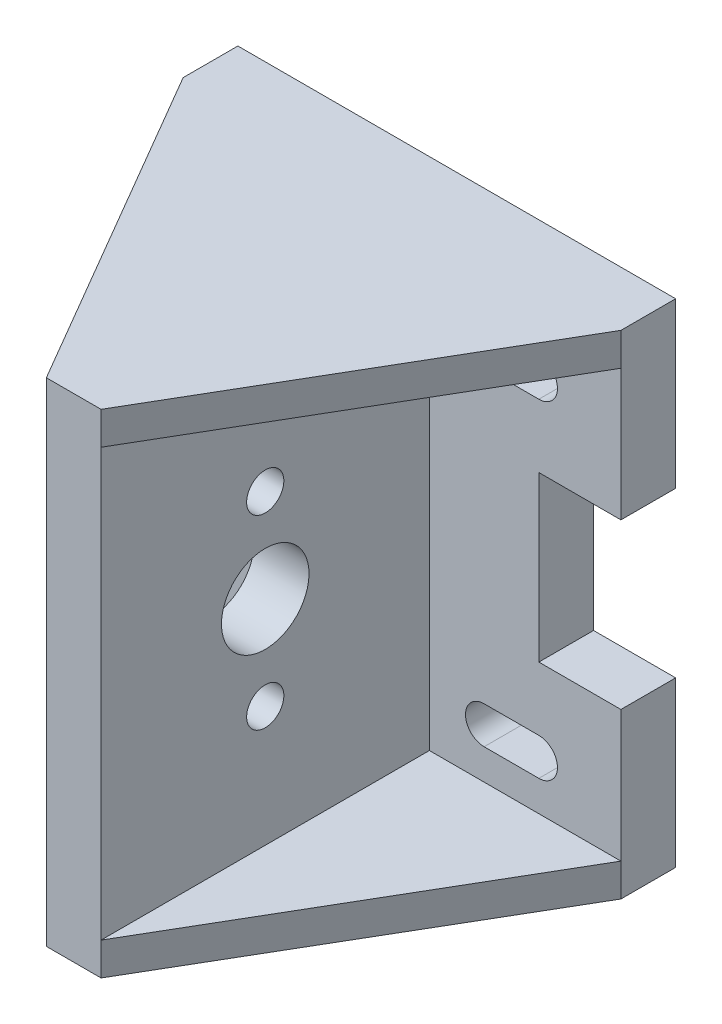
ISO-10303-21;
HEADER;
FILE_DESCRIPTION(('STEP AP214'),'2;1');
FILE_NAME('part.step','',(''),(''),'','','');
FILE_SCHEMA(('AUTOMOTIVE_DESIGN { 1 0 10303 214 1 1 1 1 }'));
ENDSEC;
DATA;
#1=APPLICATION_CONTEXT('core data for automotive mechanical design processes');
#2=APPLICATION_PROTOCOL_DEFINITION('international standard','automotive_design',2000,#1);
#3=PRODUCT_CONTEXT('',#1,'mechanical');
#4=PRODUCT('Part','Part','',(#3));
#5=PRODUCT_RELATED_PRODUCT_CATEGORY('part','',(#4));
#6=PRODUCT_DEFINITION_FORMATION('','',#4);
#7=PRODUCT_DEFINITION_CONTEXT('part definition',#1,'design');
#8=PRODUCT_DEFINITION('design','',#6,#7);
#9=PRODUCT_DEFINITION_SHAPE('','',#8);
#10=(LENGTH_UNIT() NAMED_UNIT(*) SI_UNIT(.MILLI.,.METRE.));
#11=(NAMED_UNIT(*) PLANE_ANGLE_UNIT() SI_UNIT($,.RADIAN.));
#12=(NAMED_UNIT(*) SI_UNIT($,.STERADIAN.) SOLID_ANGLE_UNIT());
#13=UNCERTAINTY_MEASURE_WITH_UNIT(LENGTH_MEASURE(1.E-05),#10,'distance_accuracy_value','');
#14=(GEOMETRIC_REPRESENTATION_CONTEXT(3) GLOBAL_UNCERTAINTY_ASSIGNED_CONTEXT((#13)) GLOBAL_UNIT_ASSIGNED_CONTEXT((#10,
#11,#12)) REPRESENTATION_CONTEXT('',''));
#15=CARTESIAN_POINT('',(0.,0.,0.));
#16=DIRECTION('',(0.,0.,1.));
#17=DIRECTION('',(1.,0.,0.));
#18=AXIS2_PLACEMENT_3D('',#15,#16,#17);
#19=CARTESIAN_POINT('',(0.,0.,5.));
#20=DIRECTION('',(0.,0.,1.));
#21=DIRECTION('',(1.,0.,0.));
#22=AXIS2_PLACEMENT_3D('',#19,#20,#21);
#23=PLANE('',#22);
#24=DIRECTION('',(-1.,0.,0.));
#25=VECTOR('',#24,1.);
#26=CARTESIAN_POINT('',(7.5,-13.3,5.));
#27=LINE('',#26,#25);
#28=CARTESIAN_POINT('',(12.5,-13.3,5.));
#29=VERTEX_POINT('',#28);
#30=CARTESIAN_POINT('',(7.5,-13.3,5.));
#31=VERTEX_POINT('',#30);
#32=EDGE_CURVE('E371',#29,#31,#27,.T.);
#33=ORIENTED_EDGE('',*,*,#32,.F.);
#34=CARTESIAN_POINT('',(12.5,-15.,5.));
#35=DIRECTION('',(0.,0.,1.));
#36=DIRECTION('',(1.,0.,0.));
#37=AXIS2_PLACEMENT_3D('',#34,#35,#36);
#38=CIRCLE('',#37,1.7);
#39=CARTESIAN_POINT('',(12.5,-16.7,5.));
#40=VERTEX_POINT('',#39);
#41=EDGE_CURVE('E385',#40,#29,#38,.T.);
#42=ORIENTED_EDGE('',*,*,#41,.F.);
#43=DIRECTION('',(1.,0.,0.));
#44=VECTOR('',#43,1.);
#45=CARTESIAN_POINT('',(7.5,-16.7,5.));
#46=LINE('',#45,#44);
#47=CARTESIAN_POINT('',(7.5,-16.7,5.));
#48=VERTEX_POINT('',#47);
#49=EDGE_CURVE('E383',#48,#40,#46,.T.);
#50=ORIENTED_EDGE('',*,*,#49,.F.);
#51=CARTESIAN_POINT('',(7.5,-15.,5.));
#52=DIRECTION('',(0.,0.,1.));
#53=DIRECTION('',(1.,0.,0.));
#54=AXIS2_PLACEMENT_3D('',#51,#52,#53);
#55=CIRCLE('',#54,1.7);
#56=EDGE_CURVE('E301',#31,#48,#55,.T.);
#57=ORIENTED_EDGE('',*,*,#56,.F.);
#58=EDGE_LOOP('',(#33,#42,#50,#57));
#59=FACE_BOUND('',#58,.T.);
#60=DIRECTION('',(-1.,0.,0.));
#61=VECTOR('',#60,1.);
#62=CARTESIAN_POINT('',(7.5,16.7,5.));
#63=LINE('',#62,#61);
#64=CARTESIAN_POINT('',(12.5,16.7,5.));
#65=VERTEX_POINT('',#64);
#66=CARTESIAN_POINT('',(7.5,16.7,5.));
#67=VERTEX_POINT('',#66);
#68=EDGE_CURVE('E402',#65,#67,#63,.T.);
#69=ORIENTED_EDGE('',*,*,#68,.F.);
#70=CARTESIAN_POINT('',(12.5,15.,5.));
#71=DIRECTION('',(0.,0.,1.));
#72=DIRECTION('',(1.,0.,0.));
#73=AXIS2_PLACEMENT_3D('',#70,#71,#72);
#74=CIRCLE('',#73,1.7);
#75=CARTESIAN_POINT('',(12.5,13.3,5.));
#76=VERTEX_POINT('',#75);
#77=EDGE_CURVE('E416',#76,#65,#74,.T.);
#78=ORIENTED_EDGE('',*,*,#77,.F.);
#79=DIRECTION('',(1.,0.,0.));
#80=VECTOR('',#79,1.);
#81=CARTESIAN_POINT('',(7.5,13.3,5.));
#82=LINE('',#81,#80);
#83=CARTESIAN_POINT('',(7.5,13.3,5.));
#84=VERTEX_POINT('',#83);
#85=EDGE_CURVE('E414',#84,#76,#82,.T.);
#86=ORIENTED_EDGE('',*,*,#85,.F.);
#87=CARTESIAN_POINT('',(7.5,15.,5.));
#88=DIRECTION('',(0.,0.,1.));
#89=DIRECTION('',(1.,0.,0.));
#90=AXIS2_PLACEMENT_3D('',#87,#88,#89);
#91=CIRCLE('',#90,1.7);
#92=EDGE_CURVE('E327',#67,#84,#91,.T.);
#93=ORIENTED_EDGE('',*,*,#92,.F.);
#94=EDGE_LOOP('',(#69,#78,#86,#93));
#95=FACE_BOUND('',#94,.T.);
#96=DIRECTION('',(0.,1.,0.));
#97=VECTOR('',#96,1.);
#98=CARTESIAN_POINT('',(12.5,7.5,5.));
#99=LINE('',#98,#97);
#100=CARTESIAN_POINT('',(12.5,-7.5,5.));
#101=VERTEX_POINT('',#100);
#102=CARTESIAN_POINT('',(12.5,7.5,5.));
#103=VERTEX_POINT('',#102);
#104=EDGE_CURVE('E280',#101,#103,#99,.T.);
#105=ORIENTED_EDGE('',*,*,#104,.T.);
#106=DIRECTION('',(1.,0.,0.));
#107=VECTOR('',#106,1.);
#108=CARTESIAN_POINT('',(27.5,7.5,5.));
#109=LINE('',#108,#107);
#110=CARTESIAN_POINT('',(20.,7.5,5.));
#111=VERTEX_POINT('',#110);
#112=EDGE_CURVE('E288',#103,#111,#109,.T.);
#113=ORIENTED_EDGE('',*,*,#112,.T.);
#114=DIRECTION('',(0.,1.,0.));
#115=VECTOR('',#114,1.);
#116=CARTESIAN_POINT('',(20.,22.5,5.));
#117=LINE('',#116,#115);
#118=CARTESIAN_POINT('',(20.,19.5,5.));
#119=VERTEX_POINT('',#118);
#120=EDGE_CURVE('E544',#111,#119,#117,.T.);
#121=ORIENTED_EDGE('',*,*,#120,.T.);
#122=DIRECTION('',(-1.,0.,0.));
#123=VECTOR('',#122,1.);
#124=CARTESIAN_POINT('',(20.,19.5,5.));
#125=LINE('',#124,#123);
#126=CARTESIAN_POINT('',(2.5,19.5,5.));
#127=VERTEX_POINT('',#126);
#128=EDGE_CURVE('E478',#119,#127,#125,.T.);
#129=ORIENTED_EDGE('',*,*,#128,.T.);
#130=DIRECTION('',(0.,1.,0.));
#131=VECTOR('',#130,1.);
#132=CARTESIAN_POINT('',(2.5,22.5,5.));
#133=LINE('',#132,#131);
#134=CARTESIAN_POINT('',(2.5,-19.5,5.));
#135=VERTEX_POINT('',#134);
#136=EDGE_CURVE('E537',#135,#127,#133,.T.);
#137=ORIENTED_EDGE('',*,*,#136,.F.);
#138=DIRECTION('',(-1.,0.,0.));
#139=VECTOR('',#138,1.);
#140=CARTESIAN_POINT('',(20.,-19.5,5.));
#141=LINE('',#140,#139);
#142=CARTESIAN_POINT('',(20.,-19.5,5.));
#143=VERTEX_POINT('',#142);
#144=EDGE_CURVE('E455',#143,#135,#141,.T.);
#145=ORIENTED_EDGE('',*,*,#144,.F.);
#146=CARTESIAN_POINT('',(20.,-7.5,5.));
#147=VERTEX_POINT('',#146);
#148=EDGE_CURVE('E543',#143,#147,#117,.T.);
#149=ORIENTED_EDGE('',*,*,#148,.T.);
#150=DIRECTION('',(-1.,0.,0.));
#151=VECTOR('',#150,1.);
#152=CARTESIAN_POINT('',(27.5,-7.5,5.));
#153=LINE('',#152,#151);
#154=EDGE_CURVE('E292',#147,#101,#153,.T.);
#155=ORIENTED_EDGE('',*,*,#154,.T.);
#156=EDGE_LOOP('',(#105,#113,#121,#129,#137,#145,#149,#155));
#157=FACE_BOUND('',#156,.T.);
#158=ADVANCED_FACE('F35',(#59,#95,#157),#23,.T.);
#159=CARTESIAN_POINT('',(20.,22.5,5.));
#160=DIRECTION('',(-1.,0.,0.));
#161=DIRECTION('',(0.,-1.,0.));
#162=AXIS2_PLACEMENT_3D('',#159,#160,#161);
#163=PLANE('',#162);
#164=DIRECTION('',(0.,0.,1.));
#165=VECTOR('',#164,1.);
#166=CARTESIAN_POINT('',(20.,7.5,5.));
#167=LINE('',#166,#165);
#168=CARTESIAN_POINT('',(20.,7.5,0.));
#169=VERTEX_POINT('',#168);
#170=EDGE_CURVE('E299',#169,#111,#167,.T.);
#171=ORIENTED_EDGE('',*,*,#170,.F.);
#172=DIRECTION('',(0.,1.,0.));
#173=VECTOR('',#172,1.);
#174=CARTESIAN_POINT('',(20.,22.5,0.));
#175=LINE('',#174,#173);
#176=CARTESIAN_POINT('',(20.,22.5,0.));
#177=VERTEX_POINT('',#176);
#178=EDGE_CURVE('E534',#169,#177,#175,.T.);
#179=ORIENTED_EDGE('',*,*,#178,.T.);
#180=DIRECTION('',(0.,0.,-1.));
#181=VECTOR('',#180,1.);
#182=CARTESIAN_POINT('',(20.,22.5,5.));
#183=LINE('',#182,#181);
#184=CARTESIAN_POINT('',(20.,22.5,5.));
#185=VERTEX_POINT('',#184);
#186=EDGE_CURVE('E567',#185,#177,#183,.T.);
#187=ORIENTED_EDGE('',*,*,#186,.F.);
#188=DIRECTION('',(0.,1.,0.));
#189=VECTOR('',#188,1.);
#190=CARTESIAN_POINT('',(20.,19.5,5.));
#191=LINE('',#190,#189);
#192=EDGE_CURVE('E490',#119,#185,#191,.T.);
#193=ORIENTED_EDGE('',*,*,#192,.F.);
#194=ORIENTED_EDGE('',*,*,#120,.F.);
#195=EDGE_LOOP('',(#171,#179,#187,#193,#194));
#196=FACE_BOUND('',#195,.T.);
#197=ADVANCED_FACE('F37',(#196),#163,.F.);
#198=DIRECTION('',(0.,0.,-1.));
#199=VECTOR('',#198,1.);
#200=CARTESIAN_POINT('',(20.,-7.5,5.));
#201=LINE('',#200,#199);
#202=CARTESIAN_POINT('',(20.,-7.5,0.));
#203=VERTEX_POINT('',#202);
#204=EDGE_CURVE('E49',#147,#203,#201,.T.);
#205=ORIENTED_EDGE('',*,*,#204,.F.);
#206=ORIENTED_EDGE('',*,*,#148,.F.);
#207=CARTESIAN_POINT('',(20.,-22.5,5.));
#208=VERTEX_POINT('',#207);
#209=EDGE_CURVE('E539',#208,#143,#117,.T.);
#210=ORIENTED_EDGE('',*,*,#209,.F.);
#211=DIRECTION('',(0.,0.,-1.));
#212=VECTOR('',#211,1.);
#213=CARTESIAN_POINT('',(20.,-22.5,5.));
#214=LINE('',#213,#212);
#215=CARTESIAN_POINT('',(20.,-22.5,0.));
#216=VERTEX_POINT('',#215);
#217=EDGE_CURVE('E547',#208,#216,#214,.T.);
#218=ORIENTED_EDGE('',*,*,#217,.T.);
#219=EDGE_CURVE('E549',#216,#203,#175,.T.);
#220=ORIENTED_EDGE('',*,*,#219,.T.);
#221=EDGE_LOOP('',(#205,#206,#210,#218,#220));
#222=FACE_BOUND('',#221,.T.);
#223=ADVANCED_FACE('F618',(#222),#163,.F.);
#224=CARTESIAN_POINT('',(0.,0.,0.));
#225=DIRECTION('',(0.,0.,1.));
#226=DIRECTION('',(1.,0.,0.));
#227=AXIS2_PLACEMENT_3D('',#224,#225,#226);
#228=PLANE('',#227);
#229=CARTESIAN_POINT('',(-7.5,-15.,0.));
#230=DIRECTION('',(0.,0.,1.));
#231=DIRECTION('',(1.,0.,0.));
#232=AXIS2_PLACEMENT_3D('',#229,#230,#231);
#233=CIRCLE('',#232,1.7);
#234=CARTESIAN_POINT('',(-7.5,-16.7,0.));
#235=VERTEX_POINT('',#234);
#236=CARTESIAN_POINT('',(-7.5,-13.3,0.));
#237=VERTEX_POINT('',#236);
#238=EDGE_CURVE('E341',#235,#237,#233,.T.);
#239=ORIENTED_EDGE('',*,*,#238,.T.);
#240=DIRECTION('',(-1.,0.,0.));
#241=VECTOR('',#240,1.);
#242=CARTESIAN_POINT('',(-12.5,-13.3,0.));
#243=LINE('',#242,#241);
#244=CARTESIAN_POINT('',(-12.5,-13.3,0.));
#245=VERTEX_POINT('',#244);
#246=EDGE_CURVE('E344',#237,#245,#243,.T.);
#247=ORIENTED_EDGE('',*,*,#246,.T.);
#248=CARTESIAN_POINT('',(-12.5,-15.,0.));
#249=DIRECTION('',(0.,0.,1.));
#250=DIRECTION('',(1.,0.,0.));
#251=AXIS2_PLACEMENT_3D('',#248,#249,#250);
#252=CIRCLE('',#251,1.7);
#253=CARTESIAN_POINT('',(-12.5,-16.7,0.));
#254=VERTEX_POINT('',#253);
#255=EDGE_CURVE('E334',#245,#254,#252,.T.);
#256=ORIENTED_EDGE('',*,*,#255,.T.);
#257=DIRECTION('',(1.,0.,0.));
#258=VECTOR('',#257,1.);
#259=CARTESIAN_POINT('',(-12.5,-16.7,0.));
#260=LINE('',#259,#258);
#261=EDGE_CURVE('E337',#254,#235,#260,.T.);
#262=ORIENTED_EDGE('',*,*,#261,.T.);
#263=EDGE_LOOP('',(#239,#247,#256,#262));
#264=FACE_BOUND('',#263,.T.);
#265=CARTESIAN_POINT('',(12.5,-15.,0.));
#266=DIRECTION('',(0.,0.,1.));
#267=DIRECTION('',(1.,0.,0.));
#268=AXIS2_PLACEMENT_3D('',#265,#266,#267);
#269=CIRCLE('',#268,1.7);
#270=CARTESIAN_POINT('',(12.5,-16.7,0.));
#271=VERTEX_POINT('',#270);
#272=CARTESIAN_POINT('',(12.5,-13.3,0.));
#273=VERTEX_POINT('',#272);
#274=EDGE_CURVE('E374',#271,#273,#269,.T.);
#275=ORIENTED_EDGE('',*,*,#274,.T.);
#276=DIRECTION('',(-1.,0.,0.));
#277=VECTOR('',#276,1.);
#278=CARTESIAN_POINT('',(7.5,-13.3,0.));
#279=LINE('',#278,#277);
#280=CARTESIAN_POINT('',(7.5,-13.3,0.));
#281=VERTEX_POINT('',#280);
#282=EDGE_CURVE('E377',#273,#281,#279,.T.);
#283=ORIENTED_EDGE('',*,*,#282,.T.);
#284=CARTESIAN_POINT('',(7.5,-15.,0.));
#285=DIRECTION('',(0.,0.,1.));
#286=DIRECTION('',(1.,0.,0.));
#287=AXIS2_PLACEMENT_3D('',#284,#285,#286);
#288=CIRCLE('',#287,1.7);
#289=CARTESIAN_POINT('',(7.5,-16.7,0.));
#290=VERTEX_POINT('',#289);
#291=EDGE_CURVE('E367',#281,#290,#288,.T.);
#292=ORIENTED_EDGE('',*,*,#291,.T.);
#293=DIRECTION('',(1.,0.,0.));
#294=VECTOR('',#293,1.);
#295=CARTESIAN_POINT('',(7.5,-16.7,0.));
#296=LINE('',#295,#294);
#297=EDGE_CURVE('E370',#290,#271,#296,.T.);
#298=ORIENTED_EDGE('',*,*,#297,.T.);
#299=EDGE_LOOP('',(#275,#283,#292,#298));
#300=FACE_BOUND('',#299,.T.);
#301=CARTESIAN_POINT('',(-7.5,15.,0.));
#302=DIRECTION('',(0.,0.,1.));
#303=DIRECTION('',(1.,0.,0.));
#304=AXIS2_PLACEMENT_3D('',#301,#302,#303);
#305=CIRCLE('',#304,1.7);
#306=CARTESIAN_POINT('',(-7.5,13.3,0.));
#307=VERTEX_POINT('',#306);
#308=CARTESIAN_POINT('',(-7.5,16.7,0.));
#309=VERTEX_POINT('',#308);
#310=EDGE_CURVE('E57',#307,#309,#305,.T.);
#311=ORIENTED_EDGE('',*,*,#310,.T.);
#312=DIRECTION('',(-1.,0.,0.));
#313=VECTOR('',#312,1.);
#314=CARTESIAN_POINT('',(-12.5,16.7,0.));
#315=LINE('',#314,#313);
#316=CARTESIAN_POINT('',(-12.5,16.7,0.));
#317=VERTEX_POINT('',#316);
#318=EDGE_CURVE('E310',#309,#317,#315,.T.);
#319=ORIENTED_EDGE('',*,*,#318,.T.);
#320=CARTESIAN_POINT('',(-12.5,15.,0.));
#321=DIRECTION('',(0.,0.,1.));
#322=DIRECTION('',(1.,0.,0.));
#323=AXIS2_PLACEMENT_3D('',#320,#321,#322);
#324=CIRCLE('',#323,1.7);
#325=CARTESIAN_POINT('',(-12.5,13.3,0.));
#326=VERTEX_POINT('',#325);
#327=EDGE_CURVE('E302',#317,#326,#324,.T.);
#328=ORIENTED_EDGE('',*,*,#327,.T.);
#329=DIRECTION('',(1.,0.,0.));
#330=VECTOR('',#329,1.);
#331=CARTESIAN_POINT('',(-12.5,13.3,0.));
#332=LINE('',#331,#330);
#333=EDGE_CURVE('E305',#326,#307,#332,.T.);
#334=ORIENTED_EDGE('',*,*,#333,.T.);
#335=EDGE_LOOP('',(#311,#319,#328,#334));
#336=FACE_BOUND('',#335,.T.);
#337=CARTESIAN_POINT('',(12.5,15.,0.));
#338=DIRECTION('',(0.,0.,1.));
#339=DIRECTION('',(1.,0.,0.));
#340=AXIS2_PLACEMENT_3D('',#337,#338,#339);
#341=CIRCLE('',#340,1.7);
#342=CARTESIAN_POINT('',(12.5,13.3,0.));
#343=VERTEX_POINT('',#342);
#344=CARTESIAN_POINT('',(12.5,16.7,0.));
#345=VERTEX_POINT('',#344);
#346=EDGE_CURVE('E405',#343,#345,#341,.T.);
#347=ORIENTED_EDGE('',*,*,#346,.T.);
#348=DIRECTION('',(-1.,0.,0.));
#349=VECTOR('',#348,1.);
#350=CARTESIAN_POINT('',(7.5,16.7,0.));
#351=LINE('',#350,#349);
#352=CARTESIAN_POINT('',(7.5,16.7,0.));
#353=VERTEX_POINT('',#352);
#354=EDGE_CURVE('E408',#345,#353,#351,.T.);
#355=ORIENTED_EDGE('',*,*,#354,.T.);
#356=CARTESIAN_POINT('',(7.5,15.,0.));
#357=DIRECTION('',(0.,0.,1.));
#358=DIRECTION('',(1.,0.,0.));
#359=AXIS2_PLACEMENT_3D('',#356,#357,#358);
#360=CIRCLE('',#359,1.7);
#361=CARTESIAN_POINT('',(7.5,13.3,0.));
#362=VERTEX_POINT('',#361);
#363=EDGE_CURVE('E398',#353,#362,#360,.T.);
#364=ORIENTED_EDGE('',*,*,#363,.T.);
#365=DIRECTION('',(1.,0.,0.));
#366=VECTOR('',#365,1.);
#367=CARTESIAN_POINT('',(7.5,13.3,0.));
#368=LINE('',#367,#366);
#369=EDGE_CURVE('E401',#362,#343,#368,.T.);
#370=ORIENTED_EDGE('',*,*,#369,.T.);
#371=EDGE_LOOP('',(#347,#355,#364,#370));
#372=FACE_BOUND('',#371,.T.);
#373=DIRECTION('',(1.,0.,0.));
#374=VECTOR('',#373,1.);
#375=CARTESIAN_POINT('',(27.5,7.5,0.));
#376=LINE('',#375,#374);
#377=CARTESIAN_POINT('',(12.5,7.5,0.));
#378=VERTEX_POINT('',#377);
#379=EDGE_CURVE('E283',#378,#169,#376,.T.);
#380=ORIENTED_EDGE('',*,*,#379,.F.);
#381=DIRECTION('',(0.,1.,0.));
#382=VECTOR('',#381,1.);
#383=CARTESIAN_POINT('',(12.5,7.5,0.));
#384=LINE('',#383,#382);
#385=CARTESIAN_POINT('',(12.5,-7.5,0.));
#386=VERTEX_POINT('',#385);
#387=EDGE_CURVE('E277',#386,#378,#384,.T.);
#388=ORIENTED_EDGE('',*,*,#387,.F.);
#389=DIRECTION('',(-1.,0.,0.));
#390=VECTOR('',#389,1.);
#391=CARTESIAN_POINT('',(0.,-7.5,0.));
#392=LINE('',#391,#390);
#393=EDGE_CURVE('E11',#203,#386,#392,.T.);
#394=ORIENTED_EDGE('',*,*,#393,.F.);
#395=ORIENTED_EDGE('',*,*,#219,.F.);
#396=DIRECTION('',(1.,0.,0.));
#397=VECTOR('',#396,1.);
#398=CARTESIAN_POINT('',(-20.,-22.5,0.));
#399=LINE('',#398,#397);
#400=CARTESIAN_POINT('',(-20.,-22.5,0.));
#401=VERTEX_POINT('',#400);
#402=EDGE_CURVE('E557',#401,#216,#399,.T.);
#403=ORIENTED_EDGE('',*,*,#402,.F.);
#404=DIRECTION('',(0.,-1.,0.));
#405=VECTOR('',#404,1.);
#406=CARTESIAN_POINT('',(-20.,22.5,0.));
#407=LINE('',#406,#405);
#408=CARTESIAN_POINT('',(-20.,-7.5,0.));
#409=VERTEX_POINT('',#408);
#410=EDGE_CURVE('E553',#409,#401,#407,.T.);
#411=ORIENTED_EDGE('',*,*,#410,.F.);
#412=DIRECTION('',(1.,0.,0.));
#413=VECTOR('',#412,1.);
#414=CARTESIAN_POINT('',(0.,-7.5,0.));
#415=LINE('',#414,#413);
#416=CARTESIAN_POINT('',(-12.5,-7.5,0.));
#417=VERTEX_POINT('',#416);
#418=EDGE_CURVE('E43',#409,#417,#415,.T.);
#419=ORIENTED_EDGE('',*,*,#418,.T.);
#420=DIRECTION('',(0.,1.,0.));
#421=VECTOR('',#420,1.);
#422=CARTESIAN_POINT('',(-12.5,7.5,0.));
#423=LINE('',#422,#421);
#424=CARTESIAN_POINT('',(-12.5,7.5,0.));
#425=VERTEX_POINT('',#424);
#426=EDGE_CURVE('E431',#417,#425,#423,.T.);
#427=ORIENTED_EDGE('',*,*,#426,.T.);
#428=DIRECTION('',(-1.,0.,0.));
#429=VECTOR('',#428,1.);
#430=CARTESIAN_POINT('',(-27.5,7.5,0.));
#431=LINE('',#430,#429);
#432=CARTESIAN_POINT('',(-20.,7.5,0.));
#433=VERTEX_POINT('',#432);
#434=EDGE_CURVE('E434',#425,#433,#431,.T.);
#435=ORIENTED_EDGE('',*,*,#434,.T.);
#436=CARTESIAN_POINT('',(-20.,22.5,0.));
#437=VERTEX_POINT('',#436);
#438=EDGE_CURVE('E554',#437,#433,#407,.T.);
#439=ORIENTED_EDGE('',*,*,#438,.F.);
#440=DIRECTION('',(-1.,0.,0.));
#441=VECTOR('',#440,1.);
#442=CARTESIAN_POINT('',(-20.,22.5,0.));
#443=LINE('',#442,#441);
#444=EDGE_CURVE('E551',#177,#437,#443,.T.);
#445=ORIENTED_EDGE('',*,*,#444,.F.);
#446=ORIENTED_EDGE('',*,*,#178,.F.);
#447=EDGE_LOOP('',(#380,#388,#394,#395,#403,#411,#419,#427,#435,#439,#445,#446));
#448=FACE_BOUND('',#447,.T.);
#449=ADVANCED_FACE('F286',(#264,#300,#336,#372,#448),#228,.F.);
#450=CARTESIAN_POINT('',(-20.,22.5,5.));
#451=DIRECTION('',(1.,0.,0.));
#452=DIRECTION('',(0.,1.,0.));
#453=AXIS2_PLACEMENT_3D('',#450,#451,#452);
#454=PLANE('',#453);
#455=DIRECTION('',(0.,-1.,0.));
#456=VECTOR('',#455,1.);
#457=CARTESIAN_POINT('',(-20.,22.5,5.));
#458=LINE('',#457,#456);
#459=CARTESIAN_POINT('',(-20.,-7.5,5.));
#460=VERTEX_POINT('',#459);
#461=CARTESIAN_POINT('',(-20.,-19.5,5.));
#462=VERTEX_POINT('',#461);
#463=EDGE_CURVE('E542',#460,#462,#458,.T.);
#464=ORIENTED_EDGE('',*,*,#463,.F.);
#465=DIRECTION('',(0.,0.,-1.));
#466=VECTOR('',#465,1.);
#467=CARTESIAN_POINT('',(-20.,-7.5,5.));
#468=LINE('',#467,#466);
#469=EDGE_CURVE('E451',#460,#409,#468,.T.);
#470=ORIENTED_EDGE('',*,*,#469,.T.);
#471=ORIENTED_EDGE('',*,*,#410,.T.);
#472=DIRECTION('',(0.,0.,-1.));
#473=VECTOR('',#472,1.);
#474=CARTESIAN_POINT('',(-20.,-22.5,5.));
#475=LINE('',#474,#473);
#476=CARTESIAN_POINT('',(-20.,-22.5,5.));
#477=VERTEX_POINT('',#476);
#478=EDGE_CURVE('E561',#477,#401,#475,.T.);
#479=ORIENTED_EDGE('',*,*,#478,.F.);
#480=DIRECTION('',(0.,-1.,0.));
#481=VECTOR('',#480,1.);
#482=CARTESIAN_POINT('',(-20.,-19.5,5.));
#483=LINE('',#482,#481);
#484=EDGE_CURVE('E471',#462,#477,#483,.T.);
#485=ORIENTED_EDGE('',*,*,#484,.F.);
#486=EDGE_LOOP('',(#464,#470,#471,#479,#485));
#487=FACE_BOUND('',#486,.T.);
#488=ADVANCED_FACE('F582',(#487),#454,.F.);
#489=CARTESIAN_POINT('',(2.5,22.5,35.));
#490=DIRECTION('',(-1.,0.,0.));
#491=DIRECTION('',(0.,-1.,0.));
#492=AXIS2_PLACEMENT_3D('',#489,#490,#491);
#493=PLANE('',#492);
#494=CARTESIAN_POINT('',(2.50000000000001,-8.5,20.));
#495=DIRECTION('',(-1.,0.,0.));
#496=DIRECTION('',(0.,-1.,0.));
#497=AXIS2_PLACEMENT_3D('',#494,#495,#496);
#498=CIRCLE('',#497,1.69999999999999);
#499=CARTESIAN_POINT('',(2.50000000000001,-8.5,21.7));
#500=VERTEX_POINT('',#499);
#501=EDGE_CURVE('E503',#500,#500,#498,.T.);
#502=ORIENTED_EDGE('',*,*,#501,.T.);
#503=EDGE_LOOP('',(#502));
#504=FACE_BOUND('',#503,.T.);
#505=CARTESIAN_POINT('',(2.5,8.5,20.));
#506=DIRECTION('',(-1.,0.,0.));
#507=DIRECTION('',(0.,-1.,0.));
#508=AXIS2_PLACEMENT_3D('',#505,#506,#507);
#509=CIRCLE('',#508,1.69999999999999);
#510=CARTESIAN_POINT('',(2.50000000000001,8.5,21.7));
#511=VERTEX_POINT('',#510);
#512=EDGE_CURVE('E509',#511,#511,#509,.T.);
#513=ORIENTED_EDGE('',*,*,#512,.T.);
#514=EDGE_LOOP('',(#513));
#515=FACE_BOUND('',#514,.T.);
#516=CARTESIAN_POINT('',(2.5,0.,20.));
#517=DIRECTION('',(1.,0.,0.));
#518=DIRECTION('',(0.,1.,0.));
#519=AXIS2_PLACEMENT_3D('',#516,#517,#518);
#520=CIRCLE('',#519,4.);
#521=CARTESIAN_POINT('',(2.5,4.,20.));
#522=VERTEX_POINT('',#521);
#523=EDGE_CURVE('E513',#522,#522,#520,.T.);
#524=ORIENTED_EDGE('',*,*,#523,.F.);
#525=EDGE_LOOP('',(#524));
#526=FACE_BOUND('',#525,.T.);
#527=DIRECTION('',(0.,0.,1.));
#528=VECTOR('',#527,1.);
#529=CARTESIAN_POINT('',(2.5,-19.5,5.));
#530=LINE('',#529,#528);
#531=CARTESIAN_POINT('',(2.50000000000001,-19.5,35.));
#532=VERTEX_POINT('',#531);
#533=EDGE_CURVE('E459',#135,#532,#530,.T.);
#534=ORIENTED_EDGE('',*,*,#533,.F.);
#535=ORIENTED_EDGE('',*,*,#136,.T.);
#536=DIRECTION('',(0.,0.,1.));
#537=VECTOR('',#536,1.);
#538=CARTESIAN_POINT('',(2.5,19.5,5.));
#539=LINE('',#538,#537);
#540=CARTESIAN_POINT('',(2.5,19.5,35.));
#541=VERTEX_POINT('',#540);
#542=EDGE_CURVE('E481',#127,#541,#539,.T.);
#543=ORIENTED_EDGE('',*,*,#542,.T.);
#544=DIRECTION('',(0.,1.,0.));
#545=VECTOR('',#544,1.);
#546=CARTESIAN_POINT('',(2.5,22.5,35.));
#547=LINE('',#546,#545);
#548=EDGE_CURVE('E527',#532,#541,#547,.T.);
#549=ORIENTED_EDGE('',*,*,#548,.F.);
#550=EDGE_LOOP('',(#534,#535,#543,#549));
#551=FACE_BOUND('',#550,.T.);
#552=ADVANCED_FACE('F662',(#504,#515,#526,#551),#493,.F.);
#553=DIRECTION('',(-1.,0.,0.));
#554=VECTOR('',#553,1.);
#555=CARTESIAN_POINT('',(-12.5,16.7,5.));
#556=LINE('',#555,#554);
#557=CARTESIAN_POINT('',(-7.5,16.7,5.));
#558=VERTEX_POINT('',#557);
#559=CARTESIAN_POINT('',(-12.5,16.7,5.));
#560=VERTEX_POINT('',#559);
#561=EDGE_CURVE('E306',#558,#560,#556,.T.);
#562=ORIENTED_EDGE('',*,*,#561,.F.);
#563=CARTESIAN_POINT('',(-7.5,15.,5.));
#564=DIRECTION('',(0.,0.,1.));
#565=DIRECTION('',(1.,0.,0.));
#566=AXIS2_PLACEMENT_3D('',#563,#564,#565);
#567=CIRCLE('',#566,1.7);
#568=CARTESIAN_POINT('',(-7.5,13.3,5.));
#569=VERTEX_POINT('',#568);
#570=EDGE_CURVE('E320',#569,#558,#567,.T.);
#571=ORIENTED_EDGE('',*,*,#570,.F.);
#572=DIRECTION('',(1.,0.,0.));
#573=VECTOR('',#572,1.);
#574=CARTESIAN_POINT('',(-12.5,13.3,5.));
#575=LINE('',#574,#573);
#576=CARTESIAN_POINT('',(-12.5,13.3,5.));
#577=VERTEX_POINT('',#576);
#578=EDGE_CURVE('E317',#577,#569,#575,.T.);
#579=ORIENTED_EDGE('',*,*,#578,.F.);
#580=CARTESIAN_POINT('',(-12.5,15.,5.));
#581=DIRECTION('',(0.,0.,1.));
#582=DIRECTION('',(1.,0.,0.));
#583=AXIS2_PLACEMENT_3D('',#580,#581,#582);
#584=CIRCLE('',#583,1.7);
#585=EDGE_CURVE('E314',#560,#577,#584,.T.);
#586=ORIENTED_EDGE('',*,*,#585,.F.);
#587=EDGE_LOOP('',(#562,#571,#579,#586));
#588=FACE_BOUND('',#587,.T.);
#589=DIRECTION('',(-1.,0.,0.));
#590=VECTOR('',#589,1.);
#591=CARTESIAN_POINT('',(-12.5,-13.3,5.));
#592=LINE('',#591,#590);
#593=CARTESIAN_POINT('',(-7.5,-13.3,5.));
#594=VERTEX_POINT('',#593);
#595=CARTESIAN_POINT('',(-12.5,-13.3,5.));
#596=VERTEX_POINT('',#595);
#597=EDGE_CURVE('E338',#594,#596,#592,.T.);
#598=ORIENTED_EDGE('',*,*,#597,.F.);
#599=CARTESIAN_POINT('',(-7.5,-15.,5.));
#600=DIRECTION('',(0.,0.,1.));
#601=DIRECTION('',(1.,0.,0.));
#602=AXIS2_PLACEMENT_3D('',#599,#600,#601);
#603=CIRCLE('',#602,1.7);
#604=CARTESIAN_POINT('',(-7.5,-16.7,5.));
#605=VERTEX_POINT('',#604);
#606=EDGE_CURVE('E354',#605,#594,#603,.T.);
#607=ORIENTED_EDGE('',*,*,#606,.F.);
#608=DIRECTION('',(1.,0.,0.));
#609=VECTOR('',#608,1.);
#610=CARTESIAN_POINT('',(-12.5,-16.7,5.));
#611=LINE('',#610,#609);
#612=CARTESIAN_POINT('',(-12.5,-16.7,5.));
#613=VERTEX_POINT('',#612);
#614=EDGE_CURVE('E351',#613,#605,#611,.T.);
#615=ORIENTED_EDGE('',*,*,#614,.F.);
#616=CARTESIAN_POINT('',(-12.5,-15.,5.));
#617=DIRECTION('',(0.,0.,1.));
#618=DIRECTION('',(1.,0.,0.));
#619=AXIS2_PLACEMENT_3D('',#616,#617,#618);
#620=CIRCLE('',#619,1.7);
#621=EDGE_CURVE('E348',#596,#613,#620,.T.);
#622=ORIENTED_EDGE('',*,*,#621,.F.);
#623=EDGE_LOOP('',(#598,#607,#615,#622));
#624=FACE_BOUND('',#623,.T.);
#625=DIRECTION('',(1.,0.,0.));
#626=VECTOR('',#625,1.);
#627=CARTESIAN_POINT('',(-27.5,-7.5,5.));
#628=LINE('',#627,#626);
#629=CARTESIAN_POINT('',(-12.5,-7.5,5.));
#630=VERTEX_POINT('',#629);
#631=EDGE_CURVE('E435',#460,#630,#628,.T.);
#632=ORIENTED_EDGE('',*,*,#631,.F.);
#633=ORIENTED_EDGE('',*,*,#463,.T.);
#634=DIRECTION('',(-1.,0.,0.));
#635=VECTOR('',#634,1.);
#636=CARTESIAN_POINT('',(-20.,-19.5,5.));
#637=LINE('',#636,#635);
#638=CARTESIAN_POINT('',(-2.5,-19.5,5.));
#639=VERTEX_POINT('',#638);
#640=EDGE_CURVE('E466',#639,#462,#637,.T.);
#641=ORIENTED_EDGE('',*,*,#640,.F.);
#642=DIRECTION('',(0.,-1.,0.));
#643=VECTOR('',#642,1.);
#644=CARTESIAN_POINT('',(-2.5,22.5,5.));
#645=LINE('',#644,#643);
#646=CARTESIAN_POINT('',(-2.5,19.5,5.));
#647=VERTEX_POINT('',#646);
#648=EDGE_CURVE('E519',#647,#639,#645,.T.);
#649=ORIENTED_EDGE('',*,*,#648,.F.);
#650=DIRECTION('',(-1.,0.,0.));
#651=VECTOR('',#650,1.);
#652=CARTESIAN_POINT('',(-20.,19.5,5.));
#653=LINE('',#652,#651);
#654=CARTESIAN_POINT('',(-20.,19.5,5.));
#655=VERTEX_POINT('',#654);
#656=EDGE_CURVE('E500',#647,#655,#653,.T.);
#657=ORIENTED_EDGE('',*,*,#656,.T.);
#658=CARTESIAN_POINT('',(-20.,7.5,5.));
#659=VERTEX_POINT('',#658);
#660=EDGE_CURVE('E548',#655,#659,#458,.T.);
#661=ORIENTED_EDGE('',*,*,#660,.T.);
#662=DIRECTION('',(-1.,0.,0.));
#663=VECTOR('',#662,1.);
#664=CARTESIAN_POINT('',(-27.5,7.5,5.));
#665=LINE('',#664,#663);
#666=CARTESIAN_POINT('',(-12.5,7.5,5.));
#667=VERTEX_POINT('',#666);
#668=EDGE_CURVE('E441',#667,#659,#665,.T.);
#669=ORIENTED_EDGE('',*,*,#668,.F.);
#670=DIRECTION('',(0.,1.,0.));
#671=VECTOR('',#670,1.);
#672=CARTESIAN_POINT('',(-12.5,7.5,5.));
#673=LINE('',#672,#671);
#674=EDGE_CURVE('E423',#630,#667,#673,.T.);
#675=ORIENTED_EDGE('',*,*,#674,.F.);
#676=EDGE_LOOP('',(#632,#633,#641,#649,#657,#661,#669,#675));
#677=FACE_BOUND('',#676,.T.);
#678=ADVANCED_FACE('F590',(#588,#624,#677),#23,.T.);
#679=CARTESIAN_POINT('',(-20.,22.5,5.));
#680=DIRECTION('',(0.,-1.,0.));
#681=DIRECTION('',(0.,0.,-1.));
#682=AXIS2_PLACEMENT_3D('',#679,#680,#681);
#683=PLANE('',#682);
#684=DIRECTION('',(0.,0.,-1.));
#685=VECTOR('',#684,1.);
#686=CARTESIAN_POINT('',(-20.,22.5,5.));
#687=LINE('',#686,#685);
#688=CARTESIAN_POINT('',(-20.,22.5,5.));
#689=VERTEX_POINT('',#688);
#690=EDGE_CURVE('E564',#689,#437,#687,.T.);
#691=ORIENTED_EDGE('',*,*,#690,.F.);
#692=DIRECTION('',(0.503871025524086,0.,0.863778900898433));
#693=VECTOR('',#692,1.);
#694=CARTESIAN_POINT('',(-2.5,22.5,35.));
#695=LINE('',#694,#693);
#696=CARTESIAN_POINT('',(-2.5,22.5,35.));
#697=VERTEX_POINT('',#696);
#698=EDGE_CURVE('E492',#689,#697,#695,.T.);
#699=ORIENTED_EDGE('',*,*,#698,.T.);
#700=DIRECTION('',(-1.,0.,0.));
#701=VECTOR('',#700,1.);
#702=CARTESIAN_POINT('',(-2.5,22.5,35.));
#703=LINE('',#702,#701);
#704=CARTESIAN_POINT('',(2.5,22.5,35.));
#705=VERTEX_POINT('',#704);
#706=EDGE_CURVE('E531',#705,#697,#703,.T.);
#707=ORIENTED_EDGE('',*,*,#706,.F.);
#708=DIRECTION('',(0.503871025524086,0.,-0.863778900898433));
#709=VECTOR('',#708,1.);
#710=CARTESIAN_POINT('',(2.5,22.5,35.));
#711=LINE('',#710,#709);
#712=EDGE_CURVE('E476',#705,#185,#711,.T.);
#713=ORIENTED_EDGE('',*,*,#712,.T.);
#714=ORIENTED_EDGE('',*,*,#186,.T.);
#715=ORIENTED_EDGE('',*,*,#444,.T.);
#716=EDGE_LOOP('',(#691,#699,#707,#713,#714,#715));
#717=FACE_BOUND('',#716,.T.);
#718=ADVANCED_FACE('F604',(#717),#683,.F.);
#719=ORIENTED_EDGE('',*,*,#438,.T.);
#720=DIRECTION('',(0.,0.,1.));
#721=VECTOR('',#720,1.);
#722=CARTESIAN_POINT('',(-20.,7.5,5.));
#723=LINE('',#722,#721);
#724=EDGE_CURVE('E447',#433,#659,#723,.T.);
#725=ORIENTED_EDGE('',*,*,#724,.T.);
#726=ORIENTED_EDGE('',*,*,#660,.F.);
#727=EDGE_CURVE('E545',#689,#655,#458,.T.);
#728=ORIENTED_EDGE('',*,*,#727,.F.);
#729=ORIENTED_EDGE('',*,*,#690,.T.);
#730=EDGE_LOOP('',(#719,#725,#726,#728,#729));
#731=FACE_BOUND('',#730,.T.);
#732=ADVANCED_FACE('F595',(#731),#454,.F.);
#733=CARTESIAN_POINT('',(-20.,-22.5,5.));
#734=DIRECTION('',(0.,1.,0.));
#735=DIRECTION('',(0.,0.,1.));
#736=AXIS2_PLACEMENT_3D('',#733,#734,#735);
#737=PLANE('',#736);
#738=ORIENTED_EDGE('',*,*,#217,.F.);
#739=DIRECTION('',(0.503871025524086,0.,-0.863778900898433));
#740=VECTOR('',#739,1.);
#741=CARTESIAN_POINT('',(2.5,-22.5,35.));
#742=LINE('',#741,#740);
#743=CARTESIAN_POINT('',(2.5,-22.5,35.));
#744=VERTEX_POINT('',#743);
#745=EDGE_CURVE('E454',#744,#208,#742,.T.);
#746=ORIENTED_EDGE('',*,*,#745,.F.);
#747=DIRECTION('',(1.,0.,0.));
#748=VECTOR('',#747,1.);
#749=CARTESIAN_POINT('',(-2.5,-22.5,35.));
#750=LINE('',#749,#748);
#751=CARTESIAN_POINT('',(-2.5,-22.5,35.));
#752=VERTEX_POINT('',#751);
#753=EDGE_CURVE('E523',#752,#744,#750,.T.);
#754=ORIENTED_EDGE('',*,*,#753,.F.);
#755=DIRECTION('',(0.503871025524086,0.,0.863778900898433));
#756=VECTOR('',#755,1.);
#757=CARTESIAN_POINT('',(-2.5,-22.5,35.));
#758=LINE('',#757,#756);
#759=EDGE_CURVE('E462',#477,#752,#758,.T.);
#760=ORIENTED_EDGE('',*,*,#759,.F.);
#761=ORIENTED_EDGE('',*,*,#478,.T.);
#762=ORIENTED_EDGE('',*,*,#402,.T.);
#763=EDGE_LOOP('',(#738,#746,#754,#760,#761,#762));
#764=FACE_BOUND('',#763,.T.);
#765=ADVANCED_FACE('F622',(#764),#737,.F.);
#766=CARTESIAN_POINT('',(-2.5,22.5,35.));
#767=DIRECTION('',(1.,0.,0.));
#768=DIRECTION('',(0.,1.,0.));
#769=AXIS2_PLACEMENT_3D('',#766,#767,#768);
#770=PLANE('',#769);
#771=CARTESIAN_POINT('',(-2.5,-8.5,20.));
#772=DIRECTION('',(1.,0.,0.));
#773=DIRECTION('',(0.,1.,0.));
#774=AXIS2_PLACEMENT_3D('',#771,#772,#773);
#775=CIRCLE('',#774,1.69999999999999);
#776=CARTESIAN_POINT('',(-2.5,-8.5,21.7));
#777=VERTEX_POINT('',#776);
#778=EDGE_CURVE('E506',#777,#777,#775,.T.);
#779=ORIENTED_EDGE('',*,*,#778,.T.);
#780=EDGE_LOOP('',(#779));
#781=FACE_BOUND('',#780,.T.);
#782=CARTESIAN_POINT('',(-2.5,8.5,20.));
#783=DIRECTION('',(1.,0.,0.));
#784=DIRECTION('',(0.,1.,0.));
#785=AXIS2_PLACEMENT_3D('',#782,#783,#784);
#786=CIRCLE('',#785,1.69999999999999);
#787=CARTESIAN_POINT('',(-2.50000000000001,8.5,21.7));
#788=VERTEX_POINT('',#787);
#789=EDGE_CURVE('E510',#788,#788,#786,.T.);
#790=ORIENTED_EDGE('',*,*,#789,.T.);
#791=EDGE_LOOP('',(#790));
#792=FACE_BOUND('',#791,.T.);
#793=CARTESIAN_POINT('',(-2.5,0.,20.));
#794=DIRECTION('',(1.,0.,0.));
#795=DIRECTION('',(0.,1.,0.));
#796=AXIS2_PLACEMENT_3D('',#793,#794,#795);
#797=CIRCLE('',#796,4.);
#798=CARTESIAN_POINT('',(-2.5,4.,20.));
#799=VERTEX_POINT('',#798);
#800=EDGE_CURVE('E516',#799,#799,#797,.T.);
#801=ORIENTED_EDGE('',*,*,#800,.T.);
#802=EDGE_LOOP('',(#801));
#803=FACE_BOUND('',#802,.T.);
#804=ORIENTED_EDGE('',*,*,#648,.T.);
#805=DIRECTION('',(0.,0.,-1.));
#806=VECTOR('',#805,1.);
#807=CARTESIAN_POINT('',(-2.5,-19.5,5.));
#808=LINE('',#807,#806);
#809=CARTESIAN_POINT('',(-2.5,-19.5,35.));
#810=VERTEX_POINT('',#809);
#811=EDGE_CURVE('E469',#810,#639,#808,.T.);
#812=ORIENTED_EDGE('',*,*,#811,.F.);
#813=DIRECTION('',(0.,-1.,0.));
#814=VECTOR('',#813,1.);
#815=CARTESIAN_POINT('',(-2.5,22.5,35.));
#816=LINE('',#815,#814);
#817=CARTESIAN_POINT('',(-2.5,19.5,35.));
#818=VERTEX_POINT('',#817);
#819=EDGE_CURVE('E524',#818,#810,#816,.T.);
#820=ORIENTED_EDGE('',*,*,#819,.F.);
#821=DIRECTION('',(0.,0.,-1.));
#822=VECTOR('',#821,1.);
#823=CARTESIAN_POINT('',(-2.5,19.5,5.));
#824=LINE('',#823,#822);
#825=EDGE_CURVE('E497',#818,#647,#824,.T.);
#826=ORIENTED_EDGE('',*,*,#825,.T.);
#827=EDGE_LOOP('',(#804,#812,#820,#826));
#828=FACE_BOUND('',#827,.T.);
#829=ADVANCED_FACE('F636',(#781,#792,#803,#828),#770,.F.);
#830=CARTESIAN_POINT('',(0.,0.,35.));
#831=DIRECTION('',(0.,0.,1.));
#832=DIRECTION('',(1.,0.,0.));
#833=AXIS2_PLACEMENT_3D('',#830,#831,#832);
#834=PLANE('',#833);
#835=EDGE_CURVE('E520',#697,#818,#816,.T.);
#836=ORIENTED_EDGE('',*,*,#835,.T.);
#837=ORIENTED_EDGE('',*,*,#819,.T.);
#838=DIRECTION('',(0.,-1.,0.));
#839=VECTOR('',#838,1.);
#840=CARTESIAN_POINT('',(-2.5,-19.5,35.));
#841=LINE('',#840,#839);
#842=EDGE_CURVE('E473',#810,#752,#841,.T.);
#843=ORIENTED_EDGE('',*,*,#842,.T.);
#844=ORIENTED_EDGE('',*,*,#753,.T.);
#845=EDGE_CURVE('E528',#744,#532,#547,.T.);
#846=ORIENTED_EDGE('',*,*,#845,.T.);
#847=ORIENTED_EDGE('',*,*,#548,.T.);
#848=DIRECTION('',(0.,1.,0.));
#849=VECTOR('',#848,1.);
#850=CARTESIAN_POINT('',(2.5,19.5,35.));
#851=LINE('',#850,#849);
#852=EDGE_CURVE('E487',#541,#705,#851,.T.);
#853=ORIENTED_EDGE('',*,*,#852,.T.);
#854=ORIENTED_EDGE('',*,*,#706,.T.);
#855=EDGE_LOOP('',(#836,#837,#843,#844,#846,#847,#853,#854));
#856=FACE_BOUND('',#855,.T.);
#857=ADVANCED_FACE('F633',(#856),#834,.T.);
#858=CARTESIAN_POINT('',(-20.,0.,20.));
#859=DIRECTION('',(1.,0.,0.));
#860=DIRECTION('',(0.,1.,0.));
#861=AXIS2_PLACEMENT_3D('',#858,#859,#860);
#862=CYLINDRICAL_SURFACE('',#861,4.);
#863=CARTESIAN_POINT('',(2.5,4.,20.));
#864=CARTESIAN_POINT('',(2.44791666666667,4.,20.));
#865=CARTESIAN_POINT('',(2.39583333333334,4.,20.));
#866=CARTESIAN_POINT('',(2.29166666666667,4.,20.));
#867=CARTESIAN_POINT('',(2.23958333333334,4.,20.));
#868=CARTESIAN_POINT('',(2.13541666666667,4.,20.));
#869=CARTESIAN_POINT('',(2.08333333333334,4.,20.));
#870=CARTESIAN_POINT('',(1.97916666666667,4.,20.));
#871=CARTESIAN_POINT('',(1.92708333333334,4.,20.));
#872=CARTESIAN_POINT('',(1.82291666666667,4.,20.));
#873=CARTESIAN_POINT('',(1.77083333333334,4.,20.));
#874=CARTESIAN_POINT('',(1.66666666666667,4.,20.));
#875=CARTESIAN_POINT('',(1.61458333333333,4.,20.));
#876=CARTESIAN_POINT('',(1.51041666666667,4.,20.));
#877=CARTESIAN_POINT('',(1.45833333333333,4.,20.));
#878=CARTESIAN_POINT('',(1.35416666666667,4.,20.));
#879=CARTESIAN_POINT('',(1.30208333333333,4.,20.));
#880=CARTESIAN_POINT('',(1.19791666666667,4.,20.));
#881=CARTESIAN_POINT('',(1.14583333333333,4.,20.));
#882=CARTESIAN_POINT('',(1.04166666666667,4.,20.));
#883=CARTESIAN_POINT('',(0.989583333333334,4.,20.));
#884=CARTESIAN_POINT('',(0.885416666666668,4.,20.));
#885=CARTESIAN_POINT('',(0.833333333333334,4.,20.));
#886=CARTESIAN_POINT('',(0.729166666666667,4.,20.));
#887=CARTESIAN_POINT('',(0.677083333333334,4.,20.));
#888=CARTESIAN_POINT('',(0.572916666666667,4.,20.));
#889=CARTESIAN_POINT('',(0.520833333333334,4.,20.));
#890=CARTESIAN_POINT('',(0.416666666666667,4.,20.));
#891=CARTESIAN_POINT('',(0.364583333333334,4.,20.));
#892=CARTESIAN_POINT('',(0.260416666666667,4.,20.));
#893=CARTESIAN_POINT('',(0.208333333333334,4.,20.));
#894=CARTESIAN_POINT('',(0.104166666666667,4.,20.));
#895=CARTESIAN_POINT('',(0.0520833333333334,4.,20.));
#896=CARTESIAN_POINT('',(-0.0520833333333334,4.,20.));
#897=CARTESIAN_POINT('',(-0.104166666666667,4.,20.));
#898=CARTESIAN_POINT('',(-0.208333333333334,4.,20.));
#899=CARTESIAN_POINT('',(-0.260416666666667,4.,20.));
#900=CARTESIAN_POINT('',(-0.364583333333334,4.,20.));
#901=CARTESIAN_POINT('',(-0.416666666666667,4.,20.));
#902=CARTESIAN_POINT('',(-0.520833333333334,4.,20.));
#903=CARTESIAN_POINT('',(-0.572916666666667,4.,20.));
#904=CARTESIAN_POINT('',(-0.677083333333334,4.,20.));
#905=CARTESIAN_POINT('',(-0.729166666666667,4.,20.));
#906=CARTESIAN_POINT('',(-0.833333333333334,4.,20.));
#907=CARTESIAN_POINT('',(-0.885416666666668,4.,20.));
#908=CARTESIAN_POINT('',(-0.989583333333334,4.,20.));
#909=CARTESIAN_POINT('',(-1.04166666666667,4.,20.));
#910=CARTESIAN_POINT('',(-1.14583333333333,4.,20.));
#911=CARTESIAN_POINT('',(-1.19791666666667,4.,20.));
#912=CARTESIAN_POINT('',(-1.30208333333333,4.,20.));
#913=CARTESIAN_POINT('',(-1.35416666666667,4.,20.));
#914=CARTESIAN_POINT('',(-1.45833333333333,4.,20.));
#915=CARTESIAN_POINT('',(-1.51041666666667,4.,20.));
#916=CARTESIAN_POINT('',(-1.61458333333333,4.,20.));
#917=CARTESIAN_POINT('',(-1.66666666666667,4.,20.));
#918=CARTESIAN_POINT('',(-1.77083333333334,4.,20.));
#919=CARTESIAN_POINT('',(-1.82291666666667,4.,20.));
#920=CARTESIAN_POINT('',(-1.92708333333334,4.,20.));
#921=CARTESIAN_POINT('',(-1.97916666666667,4.,20.));
#922=CARTESIAN_POINT('',(-2.08333333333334,4.,20.));
#923=CARTESIAN_POINT('',(-2.13541666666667,4.,20.));
#924=CARTESIAN_POINT('',(-2.23958333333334,4.,20.));
#925=CARTESIAN_POINT('',(-2.29166666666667,4.,20.));
#926=CARTESIAN_POINT('',(-2.39583333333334,4.,20.));
#927=CARTESIAN_POINT('',(-2.44791666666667,4.,20.));
#928=CARTESIAN_POINT('',(-2.5,4.,20.));
#929=B_SPLINE_CURVE_WITH_KNOTS('',3,(#863,#864,#865,#866,#867,#868,#869,#870,#871,#872,#873,
#874,#875,#876,#877,#878,#879,#880,#881,#882,#883,#884,#885,#886,#887,#888,#889,#890,#891,#892,
#893,#894,#895,#896,#897,#898,#899,#900,#901,#902,#903,#904,#905,#906,#907,#908,#909,#910,#911,
#912,#913,#914,#915,#916,#917,#918,#919,#920,#921,#922,#923,#924,#925,#926,#927,#928),
.UNSPECIFIED.,.F.,.F.,(4,2,2,2,2,2,2,2,2,2,2,2,2,2,2,2,2,2,2,2,2,2,2,2,2,2,2,2,2,2,2,2,4),(0.,
0.15625,0.3125,0.46875,0.625000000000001,0.781250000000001,0.937500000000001,1.09375,1.25,
1.40625,1.5625,1.71875,1.875,2.03125,2.1875,2.34375,2.5,2.65625,2.8125,2.96875,3.125,3.28125,
3.4375,3.59375,3.75,3.90625,4.0625,4.21875,4.375,4.53125,4.6875,4.84375,5.),.UNSPECIFIED.);
#930=EDGE_CURVE('BSEAM776',#522,#799,#929,.T.);
#931=ORIENTED_EDGE('',*,*,#523,.T.);
#932=ORIENTED_EDGE('',*,*,#800,.F.);
#933=ORIENTED_EDGE('',*,*,#930,.T.);
#934=ORIENTED_EDGE('',*,*,#930,.F.);
#935=EDGE_LOOP('',(#931,#933,#932,#934));
#936=FACE_BOUND('',#935,.T.);
#937=ADVANCED_FACE('F776',(#936),#862,.F.);
#938=CARTESIAN_POINT('',(-20.,8.5,20.));
#939=DIRECTION('',(-1.,0.,0.));
#940=DIRECTION('',(0.,0.,1.));
#941=AXIS2_PLACEMENT_3D('',#938,#939,#940);
#942=CYLINDRICAL_SURFACE('',#941,1.69999999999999);
#943=CARTESIAN_POINT('',(2.50000000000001,8.5,21.7));
#944=CARTESIAN_POINT('',(2.44791666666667,8.5,21.7));
#945=CARTESIAN_POINT('',(2.39583333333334,8.5,21.7));
#946=CARTESIAN_POINT('',(2.29166666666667,8.5,21.7));
#947=CARTESIAN_POINT('',(2.23958333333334,8.5,21.7));
#948=CARTESIAN_POINT('',(2.13541666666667,8.5,21.7));
#949=CARTESIAN_POINT('',(2.08333333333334,8.5,21.7));
#950=CARTESIAN_POINT('',(1.97916666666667,8.5,21.7));
#951=CARTESIAN_POINT('',(1.92708333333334,8.5,21.7));
#952=CARTESIAN_POINT('',(1.82291666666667,8.5,21.7));
#953=CARTESIAN_POINT('',(1.77083333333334,8.5,21.7));
#954=CARTESIAN_POINT('',(1.66666666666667,8.5,21.7));
#955=CARTESIAN_POINT('',(1.61458333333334,8.5,21.7));
#956=CARTESIAN_POINT('',(1.51041666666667,8.5,21.7));
#957=CARTESIAN_POINT('',(1.45833333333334,8.5,21.7));
#958=CARTESIAN_POINT('',(1.35416666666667,8.5,21.7));
#959=CARTESIAN_POINT('',(1.30208333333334,8.5,21.7));
#960=CARTESIAN_POINT('',(1.19791666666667,8.5,21.7));
#961=CARTESIAN_POINT('',(1.14583333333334,8.5,21.7));
#962=CARTESIAN_POINT('',(1.04166666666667,8.5,21.7));
#963=CARTESIAN_POINT('',(0.989583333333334,8.5,21.7));
#964=CARTESIAN_POINT('',(0.885416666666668,8.5,21.7));
#965=CARTESIAN_POINT('',(0.833333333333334,8.5,21.7));
#966=CARTESIAN_POINT('',(0.729166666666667,8.5,21.7));
#967=CARTESIAN_POINT('',(0.677083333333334,8.5,21.7));
#968=CARTESIAN_POINT('',(0.572916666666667,8.5,21.7));
#969=CARTESIAN_POINT('',(0.520833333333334,8.5,21.7));
#970=CARTESIAN_POINT('',(0.416666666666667,8.5,21.7));
#971=CARTESIAN_POINT('',(0.364583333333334,8.5,21.7));
#972=CARTESIAN_POINT('',(0.260416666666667,8.5,21.7));
#973=CARTESIAN_POINT('',(0.208333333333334,8.5,21.7));
#974=CARTESIAN_POINT('',(0.104166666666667,8.5,21.7));
#975=CARTESIAN_POINT('',(0.0520833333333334,8.5,21.7));
#976=CARTESIAN_POINT('',(-0.0520833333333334,8.5,21.7));
#977=CARTESIAN_POINT('',(-0.104166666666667,8.5,21.7));
#978=CARTESIAN_POINT('',(-0.208333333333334,8.5,21.7));
#979=CARTESIAN_POINT('',(-0.260416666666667,8.5,21.7));
#980=CARTESIAN_POINT('',(-0.364583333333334,8.5,21.7));
#981=CARTESIAN_POINT('',(-0.416666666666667,8.5,21.7));
#982=CARTESIAN_POINT('',(-0.520833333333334,8.5,21.7));
#983=CARTESIAN_POINT('',(-0.572916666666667,8.5,21.7));
#984=CARTESIAN_POINT('',(-0.677083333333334,8.5,21.7));
#985=CARTESIAN_POINT('',(-0.729166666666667,8.5,21.7));
#986=CARTESIAN_POINT('',(-0.833333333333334,8.5,21.7));
#987=CARTESIAN_POINT('',(-0.885416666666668,8.5,21.7));
#988=CARTESIAN_POINT('',(-0.989583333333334,8.5,21.7));
#989=CARTESIAN_POINT('',(-1.04166666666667,8.5,21.7));
#990=CARTESIAN_POINT('',(-1.14583333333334,8.5,21.7));
#991=CARTESIAN_POINT('',(-1.19791666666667,8.5,21.7));
#992=CARTESIAN_POINT('',(-1.30208333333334,8.5,21.7));
#993=CARTESIAN_POINT('',(-1.35416666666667,8.5,21.7));
#994=CARTESIAN_POINT('',(-1.45833333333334,8.5,21.7));
#995=CARTESIAN_POINT('',(-1.51041666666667,8.5,21.7));
#996=CARTESIAN_POINT('',(-1.61458333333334,8.5,21.7));
#997=CARTESIAN_POINT('',(-1.66666666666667,8.5,21.7));
#998=CARTESIAN_POINT('',(-1.77083333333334,8.5,21.7));
#999=CARTESIAN_POINT('',(-1.82291666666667,8.5,21.7));
#1000=CARTESIAN_POINT('',(-1.92708333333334,8.5,21.7));
#1001=CARTESIAN_POINT('',(-1.97916666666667,8.5,21.7));
#1002=CARTESIAN_POINT('',(-2.08333333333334,8.5,21.7));
#1003=CARTESIAN_POINT('',(-2.13541666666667,8.5,21.7));
#1004=CARTESIAN_POINT('',(-2.23958333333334,8.5,21.7));
#1005=CARTESIAN_POINT('',(-2.29166666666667,8.5,21.7));
#1006=CARTESIAN_POINT('',(-2.39583333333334,8.5,21.7));
#1007=CARTESIAN_POINT('',(-2.44791666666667,8.5,21.7));
#1008=CARTESIAN_POINT('',(-2.50000000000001,8.5,21.7));
#1009=B_SPLINE_CURVE_WITH_KNOTS('',3,(#943,#944,#945,#946,#947,#948,#949,#950,#951,#952,#953,
#954,#955,#956,#957,#958,#959,#960,#961,#962,#963,#964,#965,#966,#967,#968,#969,#970,#971,#972,
#973,#974,#975,#976,#977,#978,#979,#980,#981,#982,#983,#984,#985,#986,#987,#988,#989,#990,#991,
#992,#993,#994,#995,#996,#997,#998,#999,#1000,#1001,#1002,#1003,#1004,#1005,#1006,#1007,#1008),
.UNSPECIFIED.,.F.,.F.,(4,2,2,2,2,2,2,2,2,2,2,2,2,2,2,2,2,2,2,2,2,2,2,2,2,2,2,2,2,2,2,2,4),(0.,
0.15625,0.3125,0.46875,0.625000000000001,0.781250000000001,0.937500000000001,1.09375,1.25,
1.40625,1.5625,1.71875,1.87500000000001,2.03125000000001,2.18750000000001,2.34375000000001,
2.50000000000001,2.65625000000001,2.81250000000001,2.96875000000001,3.12500000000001,
3.28125000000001,3.43750000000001,3.59375000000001,3.75000000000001,3.90625000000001,
4.06250000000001,4.21875000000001,4.37500000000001,4.53125000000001,4.68750000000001,
4.84375000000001,5.00000000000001),.UNSPECIFIED.);
#1010=EDGE_CURVE('BSEAM772',#511,#788,#1009,.T.);
#1011=ORIENTED_EDGE('',*,*,#512,.F.);
#1012=ORIENTED_EDGE('',*,*,#789,.F.);
#1013=ORIENTED_EDGE('',*,*,#1010,.T.);
#1014=ORIENTED_EDGE('',*,*,#1010,.F.);
#1015=EDGE_LOOP('',(#1011,#1013,#1012,#1014));
#1016=FACE_BOUND('',#1015,.T.);
#1017=ADVANCED_FACE('F772',(#1016),#942,.F.);
#1018=CARTESIAN_POINT('',(-20.,-8.5,20.));
#1019=DIRECTION('',(-1.,0.,0.));
#1020=DIRECTION('',(0.,0.,1.));
#1021=AXIS2_PLACEMENT_3D('',#1018,#1019,#1020);
#1022=CYLINDRICAL_SURFACE('',#1021,1.69999999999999);
#1023=CARTESIAN_POINT('',(2.50000000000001,-8.5,21.7));
#1024=CARTESIAN_POINT('',(2.44791666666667,-8.5,21.7));
#1025=CARTESIAN_POINT('',(2.39583333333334,-8.5,21.7));
#1026=CARTESIAN_POINT('',(2.29166666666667,-8.5,21.7));
#1027=CARTESIAN_POINT('',(2.23958333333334,-8.5,21.7));
#1028=CARTESIAN_POINT('',(2.13541666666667,-8.5,21.7));
#1029=CARTESIAN_POINT('',(2.08333333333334,-8.5,21.7));
#1030=CARTESIAN_POINT('',(1.97916666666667,-8.5,21.7));
#1031=CARTESIAN_POINT('',(1.92708333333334,-8.5,21.7));
#1032=CARTESIAN_POINT('',(1.82291666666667,-8.5,21.7));
#1033=CARTESIAN_POINT('',(1.77083333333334,-8.5,21.7));
#1034=CARTESIAN_POINT('',(1.66666666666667,-8.5,21.7));
#1035=CARTESIAN_POINT('',(1.61458333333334,-8.5,21.7));
#1036=CARTESIAN_POINT('',(1.51041666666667,-8.5,21.7));
#1037=CARTESIAN_POINT('',(1.45833333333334,-8.5,21.7));
#1038=CARTESIAN_POINT('',(1.35416666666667,-8.5,21.7));
#1039=CARTESIAN_POINT('',(1.30208333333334,-8.5,21.7));
#1040=CARTESIAN_POINT('',(1.19791666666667,-8.5,21.7));
#1041=CARTESIAN_POINT('',(1.14583333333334,-8.5,21.7));
#1042=CARTESIAN_POINT('',(1.04166666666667,-8.5,21.7));
#1043=CARTESIAN_POINT('',(0.989583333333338,-8.5,21.7));
#1044=CARTESIAN_POINT('',(0.885416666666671,-8.5,21.7));
#1045=CARTESIAN_POINT('',(0.833333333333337,-8.5,21.7));
#1046=CARTESIAN_POINT('',(0.729166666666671,-8.5,21.7));
#1047=CARTESIAN_POINT('',(0.677083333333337,-8.5,21.7));
#1048=CARTESIAN_POINT('',(0.572916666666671,-8.5,21.7));
#1049=CARTESIAN_POINT('',(0.520833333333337,-8.5,21.7));
#1050=CARTESIAN_POINT('',(0.416666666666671,-8.5,21.7));
#1051=CARTESIAN_POINT('',(0.364583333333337,-8.5,21.7));
#1052=CARTESIAN_POINT('',(0.26041666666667,-8.5,21.7));
#1053=CARTESIAN_POINT('',(0.208333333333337,-8.5,21.7));
#1054=CARTESIAN_POINT('',(0.10416666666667,-8.5,21.7));
#1055=CARTESIAN_POINT('',(0.0520833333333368,-8.5,21.7));
#1056=CARTESIAN_POINT('',(-0.0520833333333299,-8.5,21.7));
#1057=CARTESIAN_POINT('',(-0.104166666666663,-8.5,21.7));
#1058=CARTESIAN_POINT('',(-0.20833333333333,-8.5,21.7));
#1059=CARTESIAN_POINT('',(-0.260416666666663,-8.5,21.7));
#1060=CARTESIAN_POINT('',(-0.36458333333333,-8.5,21.7));
#1061=CARTESIAN_POINT('',(-0.416666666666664,-8.5,21.7));
#1062=CARTESIAN_POINT('',(-0.52083333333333,-8.5,21.7));
#1063=CARTESIAN_POINT('',(-0.572916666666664,-8.5,21.7));
#1064=CARTESIAN_POINT('',(-0.67708333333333,-8.5,21.7));
#1065=CARTESIAN_POINT('',(-0.729166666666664,-8.5,21.7));
#1066=CARTESIAN_POINT('',(-0.833333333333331,-8.5,21.7));
#1067=CARTESIAN_POINT('',(-0.885416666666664,-8.5,21.7));
#1068=CARTESIAN_POINT('',(-0.989583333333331,-8.5,21.7));
#1069=CARTESIAN_POINT('',(-1.04166666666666,-8.5,21.7));
#1070=CARTESIAN_POINT('',(-1.14583333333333,-8.5,21.7));
#1071=CARTESIAN_POINT('',(-1.19791666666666,-8.5,21.7));
#1072=CARTESIAN_POINT('',(-1.30208333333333,-8.5,21.7));
#1073=CARTESIAN_POINT('',(-1.35416666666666,-8.5,21.7));
#1074=CARTESIAN_POINT('',(-1.45833333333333,-8.5,21.7));
#1075=CARTESIAN_POINT('',(-1.51041666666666,-8.5,21.7));
#1076=CARTESIAN_POINT('',(-1.61458333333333,-8.5,21.7));
#1077=CARTESIAN_POINT('',(-1.66666666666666,-8.5,21.7));
#1078=CARTESIAN_POINT('',(-1.77083333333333,-8.5,21.7));
#1079=CARTESIAN_POINT('',(-1.82291666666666,-8.5,21.7));
#1080=CARTESIAN_POINT('',(-1.92708333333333,-8.5,21.7));
#1081=CARTESIAN_POINT('',(-1.97916666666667,-8.5,21.7));
#1082=CARTESIAN_POINT('',(-2.08333333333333,-8.5,21.7));
#1083=CARTESIAN_POINT('',(-2.13541666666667,-8.5,21.7));
#1084=CARTESIAN_POINT('',(-2.23958333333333,-8.5,21.7));
#1085=CARTESIAN_POINT('',(-2.29166666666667,-8.5,21.7));
#1086=CARTESIAN_POINT('',(-2.39583333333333,-8.5,21.7));
#1087=CARTESIAN_POINT('',(-2.44791666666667,-8.5,21.7));
#1088=CARTESIAN_POINT('',(-2.5,-8.5,21.7));
#1089=B_SPLINE_CURVE_WITH_KNOTS('',3,(#1023,#1024,#1025,#1026,#1027,#1028,#1029,#1030,#1031,
#1032,#1033,#1034,#1035,#1036,#1037,#1038,#1039,#1040,#1041,#1042,#1043,#1044,#1045,#1046,#1047,
#1048,#1049,#1050,#1051,#1052,#1053,#1054,#1055,#1056,#1057,#1058,#1059,#1060,#1061,#1062,#1063,
#1064,#1065,#1066,#1067,#1068,#1069,#1070,#1071,#1072,#1073,#1074,#1075,#1076,#1077,#1078,#1079,
#1080,#1081,#1082,#1083,#1084,#1085,#1086,#1087,#1088),.UNSPECIFIED.,.F.,.F.,(4,2,2,2,2,2,2,2,2,
2,2,2,2,2,2,2,2,2,2,2,2,2,2,2,2,2,2,2,2,2,2,2,4),(0.,0.15625,0.3125,0.46875,0.625000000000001,
0.781250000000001,0.937500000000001,1.09375,1.25,1.40625,1.5625,1.71875,1.875,2.03125,2.1875,
2.34375,2.5,2.65625,2.8125,2.96875,3.125,3.28125,3.4375,3.59375,3.75,3.90625,4.0625,4.21875,
4.375,4.53125,4.6875,4.84375,5.),.UNSPECIFIED.);
#1090=EDGE_CURVE('BSEAM766',#500,#777,#1089,.T.);
#1091=ORIENTED_EDGE('',*,*,#501,.F.);
#1092=ORIENTED_EDGE('',*,*,#778,.F.);
#1093=ORIENTED_EDGE('',*,*,#1090,.T.);
#1094=ORIENTED_EDGE('',*,*,#1090,.F.);
#1095=EDGE_LOOP('',(#1091,#1093,#1092,#1094));
#1096=FACE_BOUND('',#1095,.T.);
#1097=ADVANCED_FACE('F766',(#1096),#1022,.F.);
#1098=CARTESIAN_POINT('',(-2.5,19.5,35.));
#1099=DIRECTION('',(-0.863778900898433,0.,0.503871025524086));
#1100=DIRECTION('',(0.503871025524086,0.,0.863778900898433));
#1101=AXIS2_PLACEMENT_3D('',#1098,#1099,#1100);
#1102=PLANE('',#1101);
#1103=ORIENTED_EDGE('',*,*,#698,.F.);
#1104=ORIENTED_EDGE('',*,*,#727,.T.);
#1105=DIRECTION('',(0.503871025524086,0.,0.863778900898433));
#1106=VECTOR('',#1105,1.);
#1107=CARTESIAN_POINT('',(-2.5,19.5,35.));
#1108=LINE('',#1107,#1106);
#1109=EDGE_CURVE('E495',#655,#818,#1108,.T.);
#1110=ORIENTED_EDGE('',*,*,#1109,.T.);
#1111=ORIENTED_EDGE('',*,*,#835,.F.);
#1112=EDGE_LOOP('',(#1103,#1104,#1110,#1111));
#1113=FACE_BOUND('',#1112,.T.);
#1114=ADVANCED_FACE('F755',(#1113),#1102,.T.);
#1115=CARTESIAN_POINT('',(0.,19.5,0.));
#1116=DIRECTION('',(0.,-1.,0.));
#1117=DIRECTION('',(0.,0.,-1.));
#1118=AXIS2_PLACEMENT_3D('',#1115,#1116,#1117);
#1119=PLANE('',#1118);
#1120=ORIENTED_EDGE('',*,*,#1109,.F.);
#1121=ORIENTED_EDGE('',*,*,#656,.F.);
#1122=ORIENTED_EDGE('',*,*,#825,.F.);
#1123=EDGE_LOOP('',(#1120,#1121,#1122));
#1124=FACE_BOUND('',#1123,.T.);
#1125=ADVANCED_FACE('F758',(#1124),#1119,.T.);
#1126=CARTESIAN_POINT('',(2.5,19.5,35.));
#1127=DIRECTION('',(0.863778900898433,0.,0.503871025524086));
#1128=DIRECTION('',(0.503871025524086,0.,-0.863778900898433));
#1129=AXIS2_PLACEMENT_3D('',#1126,#1127,#1128);
#1130=PLANE('',#1129);
#1131=ORIENTED_EDGE('',*,*,#712,.F.);
#1132=ORIENTED_EDGE('',*,*,#852,.F.);
#1133=DIRECTION('',(0.503871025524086,0.,-0.863778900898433));
#1134=VECTOR('',#1133,1.);
#1135=CARTESIAN_POINT('',(2.5,19.5,35.));
#1136=LINE('',#1135,#1134);
#1137=EDGE_CURVE('E484',#541,#119,#1136,.T.);
#1138=ORIENTED_EDGE('',*,*,#1137,.T.);
#1139=ORIENTED_EDGE('',*,*,#192,.T.);
#1140=EDGE_LOOP('',(#1131,#1132,#1138,#1139));
#1141=FACE_BOUND('',#1140,.T.);
#1142=ADVANCED_FACE('F753',(#1141),#1130,.T.);
#1143=CARTESIAN_POINT('',(0.,19.5,0.));
#1144=DIRECTION('',(0.,1.,0.));
#1145=DIRECTION('',(0.,0.,1.));
#1146=AXIS2_PLACEMENT_3D('',#1143,#1144,#1145);
#1147=PLANE('',#1146);
#1148=ORIENTED_EDGE('',*,*,#128,.F.);
#1149=ORIENTED_EDGE('',*,*,#1137,.F.);
#1150=ORIENTED_EDGE('',*,*,#542,.F.);
#1151=EDGE_LOOP('',(#1148,#1149,#1150));
#1152=FACE_BOUND('',#1151,.T.);
#1153=ADVANCED_FACE('F650',(#1152),#1147,.F.);
#1154=CARTESIAN_POINT('',(-2.5,-19.5,35.));
#1155=DIRECTION('',(0.863778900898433,0.,-0.503871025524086));
#1156=DIRECTION('',(-0.503871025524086,0.,-0.863778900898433));
#1157=AXIS2_PLACEMENT_3D('',#1154,#1155,#1156);
#1158=PLANE('',#1157);
#1159=ORIENTED_EDGE('',*,*,#759,.T.);
#1160=ORIENTED_EDGE('',*,*,#842,.F.);
#1161=DIRECTION('',(0.503871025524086,0.,0.863778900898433));
#1162=VECTOR('',#1161,1.);
#1163=CARTESIAN_POINT('',(-2.5,-19.5,35.));
#1164=LINE('',#1163,#1162);
#1165=EDGE_CURVE('E464',#462,#810,#1164,.T.);
#1166=ORIENTED_EDGE('',*,*,#1165,.F.);
#1167=ORIENTED_EDGE('',*,*,#484,.T.);
#1168=EDGE_LOOP('',(#1159,#1160,#1166,#1167));
#1169=FACE_BOUND('',#1168,.T.);
#1170=ADVANCED_FACE('F628',(#1169),#1158,.F.);
#1171=CARTESIAN_POINT('',(0.,-19.5,0.));
#1172=DIRECTION('',(0.,1.,0.));
#1173=DIRECTION('',(0.,0.,-1.));
#1174=AXIS2_PLACEMENT_3D('',#1171,#1172,#1173);
#1175=PLANE('',#1174);
#1176=ORIENTED_EDGE('',*,*,#1165,.T.);
#1177=ORIENTED_EDGE('',*,*,#811,.T.);
#1178=ORIENTED_EDGE('',*,*,#640,.T.);
#1179=EDGE_LOOP('',(#1176,#1177,#1178));
#1180=FACE_BOUND('',#1179,.T.);
#1181=ADVANCED_FACE('F639',(#1180),#1175,.T.);
#1182=CARTESIAN_POINT('',(2.5,-19.5,35.));
#1183=DIRECTION('',(-0.863778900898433,0.,-0.503871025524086));
#1184=DIRECTION('',(-0.503871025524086,0.,0.863778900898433));
#1185=AXIS2_PLACEMENT_3D('',#1182,#1183,#1184);
#1186=PLANE('',#1185);
#1187=ORIENTED_EDGE('',*,*,#745,.T.);
#1188=ORIENTED_EDGE('',*,*,#209,.T.);
#1189=DIRECTION('',(0.503871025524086,0.,-0.863778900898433));
#1190=VECTOR('',#1189,1.);
#1191=CARTESIAN_POINT('',(2.5,-19.5,35.));
#1192=LINE('',#1191,#1190);
#1193=EDGE_CURVE('E457',#532,#143,#1192,.T.);
#1194=ORIENTED_EDGE('',*,*,#1193,.F.);
#1195=ORIENTED_EDGE('',*,*,#845,.F.);
#1196=EDGE_LOOP('',(#1187,#1188,#1194,#1195));
#1197=FACE_BOUND('',#1196,.T.);
#1198=ADVANCED_FACE('F641',(#1197),#1186,.F.);
#1199=CARTESIAN_POINT('',(0.,-19.5,0.));
#1200=DIRECTION('',(0.,-1.,0.));
#1201=DIRECTION('',(0.,0.,1.));
#1202=AXIS2_PLACEMENT_3D('',#1199,#1200,#1201);
#1203=PLANE('',#1202);
#1204=ORIENTED_EDGE('',*,*,#144,.T.);
#1205=ORIENTED_EDGE('',*,*,#533,.T.);
#1206=ORIENTED_EDGE('',*,*,#1193,.T.);
#1207=EDGE_LOOP('',(#1204,#1205,#1206));
#1208=FACE_BOUND('',#1207,.T.);
#1209=ADVANCED_FACE('F647',(#1208),#1203,.F.);
#1210=CARTESIAN_POINT('',(-27.5,-7.5,0.));
#1211=DIRECTION('',(0.,-1.,0.));
#1212=DIRECTION('',(0.,0.,-1.));
#1213=AXIS2_PLACEMENT_3D('',#1210,#1211,#1212);
#1214=PLANE('',#1213);
#1215=ORIENTED_EDGE('',*,*,#631,.T.);
#1216=DIRECTION('',(0.,0.,1.));
#1217=VECTOR('',#1216,1.);
#1218=CARTESIAN_POINT('',(-12.5,-7.5,0.));
#1219=LINE('',#1218,#1217);
#1220=EDGE_CURVE('E444',#417,#630,#1219,.T.);
#1221=ORIENTED_EDGE('',*,*,#1220,.F.);
#1222=ORIENTED_EDGE('',*,*,#418,.F.);
#1223=ORIENTED_EDGE('',*,*,#469,.F.);
#1224=EDGE_LOOP('',(#1215,#1221,#1222,#1223));
#1225=FACE_BOUND('',#1224,.T.);
#1226=ADVANCED_FACE('F578',(#1225),#1214,.F.);
#1227=CARTESIAN_POINT('',(-27.5,7.5,0.));
#1228=DIRECTION('',(0.,1.,0.));
#1229=DIRECTION('',(0.,0.,1.));
#1230=AXIS2_PLACEMENT_3D('',#1227,#1228,#1229);
#1231=PLANE('',#1230);
#1232=ORIENTED_EDGE('',*,*,#434,.F.);
#1233=DIRECTION('',(0.,0.,1.));
#1234=VECTOR('',#1233,1.);
#1235=CARTESIAN_POINT('',(-12.5,7.5,0.));
#1236=LINE('',#1235,#1234);
#1237=EDGE_CURVE('E438',#425,#667,#1236,.T.);
#1238=ORIENTED_EDGE('',*,*,#1237,.T.);
#1239=ORIENTED_EDGE('',*,*,#668,.T.);
#1240=ORIENTED_EDGE('',*,*,#724,.F.);
#1241=EDGE_LOOP('',(#1232,#1238,#1239,#1240));
#1242=FACE_BOUND('',#1241,.T.);
#1243=ADVANCED_FACE('F599',(#1242),#1231,.F.);
#1244=CARTESIAN_POINT('',(-12.5,7.5,0.));
#1245=DIRECTION('',(1.,0.,0.));
#1246=DIRECTION('',(0.,1.,0.));
#1247=AXIS2_PLACEMENT_3D('',#1244,#1245,#1246);
#1248=PLANE('',#1247);
#1249=ORIENTED_EDGE('',*,*,#674,.T.);
#1250=ORIENTED_EDGE('',*,*,#1237,.F.);
#1251=ORIENTED_EDGE('',*,*,#426,.F.);
#1252=ORIENTED_EDGE('',*,*,#1220,.T.);
#1253=EDGE_LOOP('',(#1249,#1250,#1251,#1252));
#1254=FACE_BOUND('',#1253,.T.);
#1255=ADVANCED_FACE('F721',(#1254),#1248,.F.);
#1256=CARTESIAN_POINT('',(7.5,16.7,0.));
#1257=DIRECTION('',(0.,1.,0.));
#1258=DIRECTION('',(-1.,0.,0.));
#1259=AXIS2_PLACEMENT_3D('',#1256,#1257,#1258);
#1260=PLANE('',#1259);
#1261=ORIENTED_EDGE('',*,*,#68,.T.);
#1262=DIRECTION('',(0.,0.,1.));
#1263=VECTOR('',#1262,1.);
#1264=CARTESIAN_POINT('',(7.5,16.7,0.));
#1265=LINE('',#1264,#1263);
#1266=EDGE_CURVE('E420',#353,#67,#1265,.T.);
#1267=ORIENTED_EDGE('',*,*,#1266,.F.);
#1268=ORIENTED_EDGE('',*,*,#354,.F.);
#1269=DIRECTION('',(0.,0.,1.));
#1270=VECTOR('',#1269,1.);
#1271=CARTESIAN_POINT('',(12.5,16.7,0.));
#1272=LINE('',#1271,#1270);
#1273=EDGE_CURVE('E424',#345,#65,#1272,.T.);
#1274=ORIENTED_EDGE('',*,*,#1273,.T.);
#1275=EDGE_LOOP('',(#1261,#1267,#1268,#1274));
#1276=FACE_BOUND('',#1275,.T.);
#1277=ADVANCED_FACE('F717',(#1276),#1260,.F.);
#1278=CARTESIAN_POINT('',(7.5,13.3,0.));
#1279=DIRECTION('',(0.,-1.,0.));
#1280=DIRECTION('',(1.,0.,0.));
#1281=AXIS2_PLACEMENT_3D('',#1278,#1279,#1280);
#1282=PLANE('',#1281);
#1283=ORIENTED_EDGE('',*,*,#85,.T.);
#1284=DIRECTION('',(0.,0.,1.));
#1285=VECTOR('',#1284,1.);
#1286=CARTESIAN_POINT('',(12.5,13.3,0.));
#1287=LINE('',#1286,#1285);
#1288=EDGE_CURVE('E427',#343,#76,#1287,.T.);
#1289=ORIENTED_EDGE('',*,*,#1288,.F.);
#1290=ORIENTED_EDGE('',*,*,#369,.F.);
#1291=DIRECTION('',(0.,0.,1.));
#1292=VECTOR('',#1291,1.);
#1293=CARTESIAN_POINT('',(7.5,13.3,0.));
#1294=LINE('',#1293,#1292);
#1295=EDGE_CURVE('E411',#362,#84,#1294,.T.);
#1296=ORIENTED_EDGE('',*,*,#1295,.T.);
#1297=EDGE_LOOP('',(#1283,#1289,#1290,#1296));
#1298=FACE_BOUND('',#1297,.T.);
#1299=ADVANCED_FACE('F720',(#1298),#1282,.F.);
#1300=CARTESIAN_POINT('',(7.5,15.,0.));
#1301=DIRECTION('',(0.,0.,1.));
#1302=DIRECTION('',(1.,0.,0.));
#1303=AXIS2_PLACEMENT_3D('',#1300,#1301,#1302);
#1304=CYLINDRICAL_SURFACE('',#1303,1.7);
#1305=ORIENTED_EDGE('',*,*,#92,.T.);
#1306=ORIENTED_EDGE('',*,*,#1295,.F.);
#1307=ORIENTED_EDGE('',*,*,#363,.F.);
#1308=ORIENTED_EDGE('',*,*,#1266,.T.);
#1309=EDGE_LOOP('',(#1305,#1306,#1307,#1308));
#1310=FACE_BOUND('',#1309,.T.);
#1311=ADVANCED_FACE('F725',(#1310),#1304,.F.);
#1312=CARTESIAN_POINT('',(12.5,15.,0.));
#1313=DIRECTION('',(0.,0.,1.));
#1314=DIRECTION('',(1.,0.,0.));
#1315=AXIS2_PLACEMENT_3D('',#1312,#1313,#1314);
#1316=CYLINDRICAL_SURFACE('',#1315,1.7);
#1317=ORIENTED_EDGE('',*,*,#77,.T.);
#1318=ORIENTED_EDGE('',*,*,#1273,.F.);
#1319=ORIENTED_EDGE('',*,*,#346,.F.);
#1320=ORIENTED_EDGE('',*,*,#1288,.T.);
#1321=EDGE_LOOP('',(#1317,#1318,#1319,#1320));
#1322=FACE_BOUND('',#1321,.T.);
#1323=ADVANCED_FACE('F704',(#1322),#1316,.F.);
#1324=CARTESIAN_POINT('',(7.5,-13.3,0.));
#1325=DIRECTION('',(0.,1.,0.));
#1326=DIRECTION('',(-1.,0.,0.));
#1327=AXIS2_PLACEMENT_3D('',#1324,#1325,#1326);
#1328=PLANE('',#1327);
#1329=ORIENTED_EDGE('',*,*,#32,.T.);
#1330=DIRECTION('',(0.,0.,1.));
#1331=VECTOR('',#1330,1.);
#1332=CARTESIAN_POINT('',(7.5,-13.3,0.));
#1333=LINE('',#1332,#1331);
#1334=EDGE_CURVE('E352',#281,#31,#1333,.T.);
#1335=ORIENTED_EDGE('',*,*,#1334,.F.);
#1336=ORIENTED_EDGE('',*,*,#282,.F.);
#1337=DIRECTION('',(0.,0.,1.));
#1338=VECTOR('',#1337,1.);
#1339=CARTESIAN_POINT('',(12.5,-13.3,0.));
#1340=LINE('',#1339,#1338);
#1341=EDGE_CURVE('E391',#273,#29,#1340,.T.);
#1342=ORIENTED_EDGE('',*,*,#1341,.T.);
#1343=EDGE_LOOP('',(#1329,#1335,#1336,#1342));
#1344=FACE_BOUND('',#1343,.T.);
#1345=ADVANCED_FACE('F700',(#1344),#1328,.F.);
#1346=CARTESIAN_POINT('',(7.5,-16.7,0.));
#1347=DIRECTION('',(0.,-1.,0.));
#1348=DIRECTION('',(0.,0.,-1.));
#1349=AXIS2_PLACEMENT_3D('',#1346,#1347,#1348);
#1350=PLANE('',#1349);
#1351=ORIENTED_EDGE('',*,*,#49,.T.);
#1352=DIRECTION('',(0.,0.,1.));
#1353=VECTOR('',#1352,1.);
#1354=CARTESIAN_POINT('',(12.5,-16.7,0.));
#1355=LINE('',#1354,#1353);
#1356=EDGE_CURVE('E394',#271,#40,#1355,.T.);
#1357=ORIENTED_EDGE('',*,*,#1356,.F.);
#1358=ORIENTED_EDGE('',*,*,#297,.F.);
#1359=DIRECTION('',(0.,0.,1.));
#1360=VECTOR('',#1359,1.);
#1361=CARTESIAN_POINT('',(7.5,-16.7,0.));
#1362=LINE('',#1361,#1360);
#1363=EDGE_CURVE('E380',#290,#48,#1362,.T.);
#1364=ORIENTED_EDGE('',*,*,#1363,.T.);
#1365=EDGE_LOOP('',(#1351,#1357,#1358,#1364));
#1366=FACE_BOUND('',#1365,.T.);
#1367=ADVANCED_FACE('F703',(#1366),#1350,.F.);
#1368=CARTESIAN_POINT('',(7.5,-15.,0.));
#1369=DIRECTION('',(0.,0.,1.));
#1370=DIRECTION('',(1.,0.,0.));
#1371=AXIS2_PLACEMENT_3D('',#1368,#1369,#1370);
#1372=CYLINDRICAL_SURFACE('',#1371,1.7);
#1373=ORIENTED_EDGE('',*,*,#56,.T.);
#1374=ORIENTED_EDGE('',*,*,#1363,.F.);
#1375=ORIENTED_EDGE('',*,*,#291,.F.);
#1376=ORIENTED_EDGE('',*,*,#1334,.T.);
#1377=EDGE_LOOP('',(#1373,#1374,#1375,#1376));
#1378=FACE_BOUND('',#1377,.T.);
#1379=ADVANCED_FACE('F709',(#1378),#1372,.F.);
#1380=CARTESIAN_POINT('',(12.5,-15.,0.));
#1381=DIRECTION('',(0.,0.,1.));
#1382=DIRECTION('',(1.,0.,0.));
#1383=AXIS2_PLACEMENT_3D('',#1380,#1381,#1382);
#1384=CYLINDRICAL_SURFACE('',#1383,1.7);
#1385=ORIENTED_EDGE('',*,*,#41,.T.);
#1386=ORIENTED_EDGE('',*,*,#1341,.F.);
#1387=ORIENTED_EDGE('',*,*,#274,.F.);
#1388=ORIENTED_EDGE('',*,*,#1356,.T.);
#1389=EDGE_LOOP('',(#1385,#1386,#1387,#1388));
#1390=FACE_BOUND('',#1389,.T.);
#1391=ADVANCED_FACE('F706',(#1390),#1384,.F.);
#1392=CARTESIAN_POINT('',(-12.5,-13.3,0.));
#1393=DIRECTION('',(0.,1.,0.));
#1394=DIRECTION('',(-1.,0.,0.));
#1395=AXIS2_PLACEMENT_3D('',#1392,#1393,#1394);
#1396=PLANE('',#1395);
#1397=ORIENTED_EDGE('',*,*,#597,.T.);
#1398=DIRECTION('',(0.,0.,1.));
#1399=VECTOR('',#1398,1.);
#1400=CARTESIAN_POINT('',(-12.5,-13.3,0.));
#1401=LINE('',#1400,#1399);
#1402=EDGE_CURVE('E318',#245,#596,#1401,.T.);
#1403=ORIENTED_EDGE('',*,*,#1402,.F.);
#1404=ORIENTED_EDGE('',*,*,#246,.F.);
#1405=DIRECTION('',(0.,0.,1.));
#1406=VECTOR('',#1405,1.);
#1407=CARTESIAN_POINT('',(-7.5,-13.3,0.));
#1408=LINE('',#1407,#1406);
#1409=EDGE_CURVE('E360',#237,#594,#1408,.T.);
#1410=ORIENTED_EDGE('',*,*,#1409,.T.);
#1411=EDGE_LOOP('',(#1397,#1403,#1404,#1410));
#1412=FACE_BOUND('',#1411,.T.);
#1413=ADVANCED_FACE('F678',(#1412),#1396,.F.);
#1414=CARTESIAN_POINT('',(-12.5,-16.7,0.));
#1415=DIRECTION('',(0.,-1.,0.));
#1416=DIRECTION('',(0.,0.,-1.));
#1417=AXIS2_PLACEMENT_3D('',#1414,#1415,#1416);
#1418=PLANE('',#1417);
#1419=ORIENTED_EDGE('',*,*,#614,.T.);
#1420=DIRECTION('',(0.,0.,1.));
#1421=VECTOR('',#1420,1.);
#1422=CARTESIAN_POINT('',(-7.5,-16.7,0.));
#1423=LINE('',#1422,#1421);
#1424=EDGE_CURVE('E363',#235,#605,#1423,.T.);
#1425=ORIENTED_EDGE('',*,*,#1424,.F.);
#1426=ORIENTED_EDGE('',*,*,#261,.F.);
#1427=DIRECTION('',(0.,0.,1.));
#1428=VECTOR('',#1427,1.);
#1429=CARTESIAN_POINT('',(-12.5,-16.7,0.));
#1430=LINE('',#1429,#1428);
#1431=EDGE_CURVE('E347',#254,#613,#1430,.T.);
#1432=ORIENTED_EDGE('',*,*,#1431,.T.);
#1433=EDGE_LOOP('',(#1419,#1425,#1426,#1432));
#1434=FACE_BOUND('',#1433,.T.);
#1435=ADVANCED_FACE('F683',(#1434),#1418,.F.);
#1436=CARTESIAN_POINT('',(-12.5,-15.,0.));
#1437=DIRECTION('',(0.,0.,1.));
#1438=DIRECTION('',(1.,0.,0.));
#1439=AXIS2_PLACEMENT_3D('',#1436,#1437,#1438);
#1440=CYLINDRICAL_SURFACE('',#1439,1.7);
#1441=ORIENTED_EDGE('',*,*,#621,.T.);
#1442=ORIENTED_EDGE('',*,*,#1431,.F.);
#1443=ORIENTED_EDGE('',*,*,#255,.F.);
#1444=ORIENTED_EDGE('',*,*,#1402,.T.);
#1445=EDGE_LOOP('',(#1441,#1442,#1443,#1444));
#1446=FACE_BOUND('',#1445,.T.);
#1447=ADVANCED_FACE('F689',(#1446),#1440,.F.);
#1448=CARTESIAN_POINT('',(-7.5,-15.,0.));
#1449=DIRECTION('',(0.,0.,1.));
#1450=DIRECTION('',(1.,0.,0.));
#1451=AXIS2_PLACEMENT_3D('',#1448,#1449,#1450);
#1452=CYLINDRICAL_SURFACE('',#1451,1.7);
#1453=ORIENTED_EDGE('',*,*,#606,.T.);
#1454=ORIENTED_EDGE('',*,*,#1409,.F.);
#1455=ORIENTED_EDGE('',*,*,#238,.F.);
#1456=ORIENTED_EDGE('',*,*,#1424,.T.);
#1457=EDGE_LOOP('',(#1453,#1454,#1455,#1456));
#1458=FACE_BOUND('',#1457,.T.);
#1459=ADVANCED_FACE('F680',(#1458),#1452,.F.);
#1460=CARTESIAN_POINT('',(-12.5,16.7,0.));
#1461=DIRECTION('',(0.,1.,0.));
#1462=DIRECTION('',(0.,0.,1.));
#1463=AXIS2_PLACEMENT_3D('',#1460,#1461,#1462);
#1464=PLANE('',#1463);
#1465=ORIENTED_EDGE('',*,*,#561,.T.);
#1466=DIRECTION('',(0.,0.,1.));
#1467=VECTOR('',#1466,1.);
#1468=CARTESIAN_POINT('',(-12.5,16.7,0.));
#1469=LINE('',#1468,#1467);
#1470=EDGE_CURVE('E324',#317,#560,#1469,.T.);
#1471=ORIENTED_EDGE('',*,*,#1470,.F.);
#1472=ORIENTED_EDGE('',*,*,#318,.F.);
#1473=DIRECTION('',(0.,0.,1.));
#1474=VECTOR('',#1473,1.);
#1475=CARTESIAN_POINT('',(-7.5,16.7,0.));
#1476=LINE('',#1475,#1474);
#1477=EDGE_CURVE('E328',#309,#558,#1476,.T.);
#1478=ORIENTED_EDGE('',*,*,#1477,.T.);
#1479=EDGE_LOOP('',(#1465,#1471,#1472,#1478));
#1480=FACE_BOUND('',#1479,.T.);
#1481=ADVANCED_FACE('F696',(#1480),#1464,.F.);
#1482=CARTESIAN_POINT('',(-12.5,13.3,0.));
#1483=DIRECTION('',(0.,-1.,0.));
#1484=DIRECTION('',(1.,0.,0.));
#1485=AXIS2_PLACEMENT_3D('',#1482,#1483,#1484);
#1486=PLANE('',#1485);
#1487=ORIENTED_EDGE('',*,*,#578,.T.);
#1488=DIRECTION('',(0.,0.,1.));
#1489=VECTOR('',#1488,1.);
#1490=CARTESIAN_POINT('',(-7.5,13.3,0.));
#1491=LINE('',#1490,#1489);
#1492=EDGE_CURVE('E331',#307,#569,#1491,.T.);
#1493=ORIENTED_EDGE('',*,*,#1492,.F.);
#1494=ORIENTED_EDGE('',*,*,#333,.F.);
#1495=DIRECTION('',(0.,0.,1.));
#1496=VECTOR('',#1495,1.);
#1497=CARTESIAN_POINT('',(-12.5,13.3,0.));
#1498=LINE('',#1497,#1496);
#1499=EDGE_CURVE('E313',#326,#577,#1498,.T.);
#1500=ORIENTED_EDGE('',*,*,#1499,.T.);
#1501=EDGE_LOOP('',(#1487,#1493,#1494,#1500));
#1502=FACE_BOUND('',#1501,.T.);
#1503=ADVANCED_FACE('F837',(#1502),#1486,.F.);
#1504=CARTESIAN_POINT('',(-12.5,15.,0.));
#1505=DIRECTION('',(0.,0.,1.));
#1506=DIRECTION('',(1.,0.,0.));
#1507=AXIS2_PLACEMENT_3D('',#1504,#1505,#1506);
#1508=CYLINDRICAL_SURFACE('',#1507,1.7);
#1509=ORIENTED_EDGE('',*,*,#585,.T.);
#1510=ORIENTED_EDGE('',*,*,#1499,.F.);
#1511=ORIENTED_EDGE('',*,*,#327,.F.);
#1512=ORIENTED_EDGE('',*,*,#1470,.T.);
#1513=EDGE_LOOP('',(#1509,#1510,#1511,#1512));
#1514=FACE_BOUND('',#1513,.T.);
#1515=ADVANCED_FACE('F826',(#1514),#1508,.F.);
#1516=CARTESIAN_POINT('',(-7.5,15.,0.));
#1517=DIRECTION('',(0.,0.,1.));
#1518=DIRECTION('',(1.,0.,0.));
#1519=AXIS2_PLACEMENT_3D('',#1516,#1517,#1518);
#1520=CYLINDRICAL_SURFACE('',#1519,1.7);
#1521=ORIENTED_EDGE('',*,*,#570,.T.);
#1522=ORIENTED_EDGE('',*,*,#1477,.F.);
#1523=ORIENTED_EDGE('',*,*,#310,.F.);
#1524=ORIENTED_EDGE('',*,*,#1492,.T.);
#1525=EDGE_LOOP('',(#1521,#1522,#1523,#1524));
#1526=FACE_BOUND('',#1525,.T.);
#1527=ADVANCED_FACE('F821',(#1526),#1520,.F.);
#1528=CARTESIAN_POINT('',(27.5,7.5,0.));
#1529=DIRECTION('',(0.,-1.,0.));
#1530=DIRECTION('',(0.,0.,-1.));
#1531=AXIS2_PLACEMENT_3D('',#1528,#1529,#1530);
#1532=PLANE('',#1531);
#1533=ORIENTED_EDGE('',*,*,#170,.T.);
#1534=ORIENTED_EDGE('',*,*,#112,.F.);
#1535=DIRECTION('',(0.,0.,1.));
#1536=VECTOR('',#1535,1.);
#1537=CARTESIAN_POINT('',(12.5,7.5,0.));
#1538=LINE('',#1537,#1536);
#1539=EDGE_CURVE('E282',#378,#103,#1538,.T.);
#1540=ORIENTED_EDGE('',*,*,#1539,.F.);
#1541=ORIENTED_EDGE('',*,*,#379,.T.);
#1542=EDGE_LOOP('',(#1533,#1534,#1540,#1541));
#1543=FACE_BOUND('',#1542,.T.);
#1544=ADVANCED_FACE('F611',(#1543),#1532,.T.);
#1545=CARTESIAN_POINT('',(27.5,-7.5,0.));
#1546=DIRECTION('',(0.,1.,0.));
#1547=DIRECTION('',(0.,0.,1.));
#1548=AXIS2_PLACEMENT_3D('',#1545,#1546,#1547);
#1549=PLANE('',#1548);
#1550=ORIENTED_EDGE('',*,*,#204,.T.);
#1551=ORIENTED_EDGE('',*,*,#393,.T.);
#1552=DIRECTION('',(0.,0.,1.));
#1553=VECTOR('',#1552,1.);
#1554=CARTESIAN_POINT('',(12.5,-7.5,0.));
#1555=LINE('',#1554,#1553);
#1556=EDGE_CURVE('E268',#386,#101,#1555,.T.);
#1557=ORIENTED_EDGE('',*,*,#1556,.T.);
#1558=ORIENTED_EDGE('',*,*,#154,.F.);
#1559=EDGE_LOOP('',(#1550,#1551,#1557,#1558));
#1560=FACE_BOUND('',#1559,.T.);
#1561=ADVANCED_FACE('F267',(#1560),#1549,.T.);
#1562=CARTESIAN_POINT('',(12.5,7.5,0.));
#1563=DIRECTION('',(1.,0.,0.));
#1564=DIRECTION('',(0.,1.,0.));
#1565=AXIS2_PLACEMENT_3D('',#1562,#1563,#1564);
#1566=PLANE('',#1565);
#1567=ORIENTED_EDGE('',*,*,#104,.F.);
#1568=ORIENTED_EDGE('',*,*,#1556,.F.);
#1569=ORIENTED_EDGE('',*,*,#387,.T.);
#1570=ORIENTED_EDGE('',*,*,#1539,.T.);
#1571=EDGE_LOOP('',(#1567,#1568,#1569,#1570));
#1572=FACE_BOUND('',#1571,.T.);
#1573=ADVANCED_FACE('F275',(#1572),#1566,.T.);
#1574=CLOSED_SHELL('',(#158,#197,#223,#449,#488,#552,#678,#718,#732,#765,#829,#857,#937,#1017,
#1097,#1114,#1125,#1142,#1153,#1170,#1181,#1198,#1209,#1226,#1243,#1255,#1277,#1299,#1311,#1323,
#1345,#1367,#1379,#1391,#1413,#1435,#1447,#1459,#1481,#1503,#1515,#1527,#1544,#1561,#1573));
#1575=MANIFOLD_SOLID_BREP('B2',#1574);
#1576=ADVANCED_BREP_SHAPE_REPRESENTATION('',(#18,#1575),#14);
#1577=SHAPE_DEFINITION_REPRESENTATION(#9,#1576);
ENDSEC;
END-ISO-10303-21;
